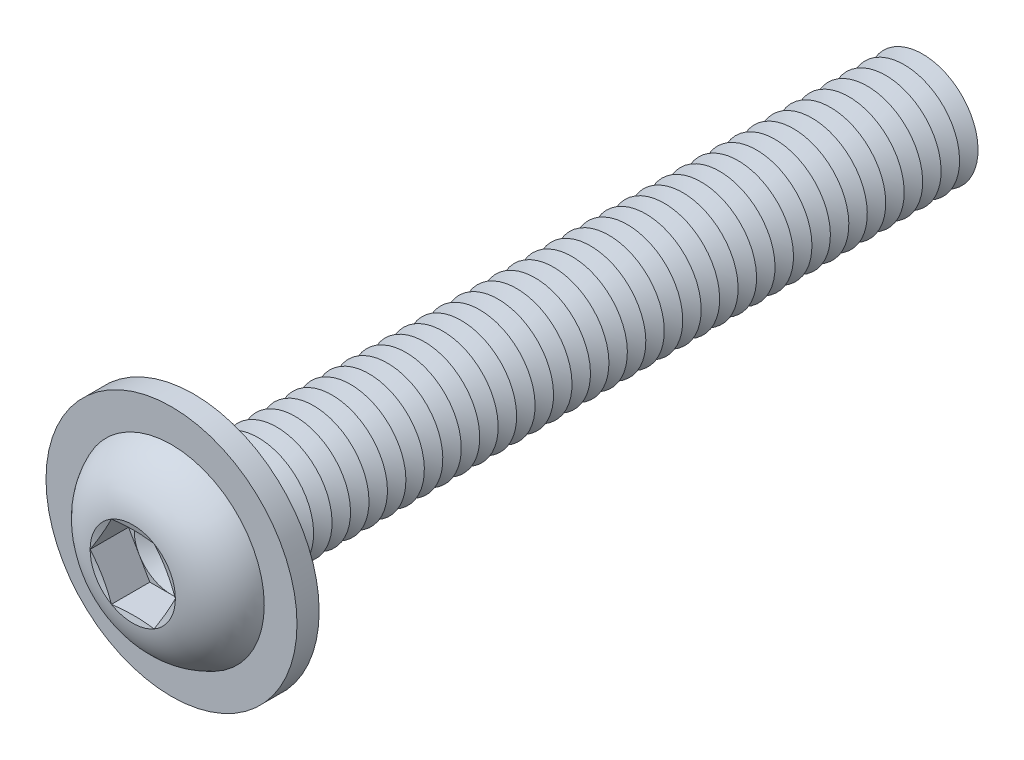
ISO-10303-21;
HEADER;
FILE_DESCRIPTION(('STEP AP214'),'2;1');
FILE_NAME('part.step','',(''),(''),'','','');
FILE_SCHEMA(('AUTOMOTIVE_DESIGN { 1 0 10303 214 1 1 1 1 }'));
ENDSEC;
DATA;
#1=APPLICATION_CONTEXT('core data for automotive mechanical design processes');
#2=APPLICATION_PROTOCOL_DEFINITION('international standard','automotive_design',2000,#1);
#3=PRODUCT_CONTEXT('',#1,'mechanical');
#4=PRODUCT('Part','Part','',(#3));
#5=PRODUCT_RELATED_PRODUCT_CATEGORY('part','',(#4));
#6=PRODUCT_DEFINITION_FORMATION('','',#4);
#7=PRODUCT_DEFINITION_CONTEXT('part definition',#1,'design');
#8=PRODUCT_DEFINITION('design','',#6,#7);
#9=PRODUCT_DEFINITION_SHAPE('','',#8);
#10=(LENGTH_UNIT() NAMED_UNIT(*) SI_UNIT(.MILLI.,.METRE.));
#11=(NAMED_UNIT(*) PLANE_ANGLE_UNIT() SI_UNIT($,.RADIAN.));
#12=(NAMED_UNIT(*) SI_UNIT($,.STERADIAN.) SOLID_ANGLE_UNIT());
#13=UNCERTAINTY_MEASURE_WITH_UNIT(LENGTH_MEASURE(1.E-05),#10,'distance_accuracy_value','');
#14=(GEOMETRIC_REPRESENTATION_CONTEXT(3) GLOBAL_UNCERTAINTY_ASSIGNED_CONTEXT((#13)) GLOBAL_UNIT_ASSIGNED_CONTEXT((#10,
#11,#12)) REPRESENTATION_CONTEXT('',''));
#15=CARTESIAN_POINT('',(0.,0.,0.));
#16=DIRECTION('',(0.,0.,1.));
#17=DIRECTION('',(1.,0.,0.));
#18=AXIS2_PLACEMENT_3D('',#15,#16,#17);
#19=CARTESIAN_POINT('',(0.,0.,-36.5));
#20=DIRECTION('',(0.,0.,1.));
#21=DIRECTION('',(0.,-1.,0.));
#22=AXIS2_PLACEMENT_3D('',#19,#20,#21);
#23=CONICAL_SURFACE('',#22,2.99999999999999,1.0471975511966);
#24=CARTESIAN_POINT('',(0.,0.,-37.));
#25=DIRECTION('',(0.,0.,1.));
#26=DIRECTION('',(0.,-1.,0.));
#27=AXIS2_PLACEMENT_3D('',#24,#25,#26);
#28=CIRCLE('',#27,2.13397459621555);
#29=CARTESIAN_POINT('',(0.,-2.13397459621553,-37.));
#30=VERTEX_POINT('',#29);
#31=EDGE_CURVE('E530',#30,#30,#28,.T.);
#32=ORIENTED_EDGE('',*,*,#31,.T.);
#33=EDGE_LOOP('',(#32));
#34=FACE_BOUND('',#33,.T.);
#35=CARTESIAN_POINT('',(0.,0.,-36.5));
#36=DIRECTION('',(0.,0.,1.));
#37=DIRECTION('',(0.,-1.,0.));
#38=AXIS2_PLACEMENT_3D('',#35,#36,#37);
#39=CIRCLE('',#38,2.99999999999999);
#40=CARTESIAN_POINT('',(0.,-2.99999999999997,-36.5));
#41=VERTEX_POINT('',#40);
#42=EDGE_CURVE('E526',#41,#41,#39,.T.);
#43=ORIENTED_EDGE('',*,*,#42,.F.);
#44=EDGE_LOOP('',(#43));
#45=FACE_BOUND('',#44,.T.);
#46=ADVANCED_FACE('F39',(#34,#45),#23,.T.);
#47=CARTESIAN_POINT('',(0.,0.,-37.));
#48=DIRECTION('',(0.,0.,-1.));
#49=DIRECTION('',(0.,1.,0.));
#50=AXIS2_PLACEMENT_3D('',#47,#48,#49);
#51=CONICAL_SURFACE('',#50,2.13397459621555,1.0471975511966);
#52=CARTESIAN_POINT('',(0.,0.,-37.5));
#53=DIRECTION('',(0.,0.,1.));
#54=DIRECTION('',(0.,-1.,0.));
#55=AXIS2_PLACEMENT_3D('',#52,#53,#54);
#56=CIRCLE('',#55,2.99999999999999);
#57=CARTESIAN_POINT('',(0.,-2.99999999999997,-37.5));
#58=VERTEX_POINT('',#57);
#59=EDGE_CURVE('E534',#58,#58,#56,.T.);
#60=ORIENTED_EDGE('',*,*,#59,.T.);
#61=EDGE_LOOP('',(#60));
#62=FACE_BOUND('',#61,.T.);
#63=ORIENTED_EDGE('',*,*,#31,.F.);
#64=EDGE_LOOP('',(#63));
#65=FACE_BOUND('',#64,.T.);
#66=ADVANCED_FACE('F649',(#62,#65),#51,.T.);
#67=CARTESIAN_POINT('',(0.,3.,-40.));
#68=DIRECTION('',(0.,0.,-1.));
#69=DIRECTION('',(0.,1.,0.));
#70=AXIS2_PLACEMENT_3D('',#67,#68,#69);
#71=PLANE('',#70);
#72=CARTESIAN_POINT('',(0.,0.,-40.));
#73=DIRECTION('',(0.,0.,1.));
#74=DIRECTION('',(0.,-1.,0.));
#75=AXIS2_PLACEMENT_3D('',#72,#73,#74);
#76=CIRCLE('',#75,2.13397459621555);
#77=CARTESIAN_POINT('',(0.,-2.13397459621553,-40.));
#78=VERTEX_POINT('',#77);
#79=EDGE_CURVE('E553',#78,#78,#76,.T.);
#80=ORIENTED_EDGE('',*,*,#79,.F.);
#81=EDGE_LOOP('',(#80));
#82=FACE_BOUND('',#81,.T.);
#83=ADVANCED_FACE('F655',(#82),#71,.T.);
#84=CARTESIAN_POINT('',(0.,0.,-39.5));
#85=DIRECTION('',(0.,0.,1.));
#86=DIRECTION('',(0.,-1.,0.));
#87=AXIS2_PLACEMENT_3D('',#84,#85,#86);
#88=CONICAL_SURFACE('',#87,2.99999999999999,1.0471975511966);
#89=ORIENTED_EDGE('',*,*,#79,.T.);
#90=EDGE_LOOP('',(#89));
#91=FACE_BOUND('',#90,.T.);
#92=CARTESIAN_POINT('',(0.,0.,-39.5));
#93=DIRECTION('',(0.,0.,1.));
#94=DIRECTION('',(0.,-1.,0.));
#95=AXIS2_PLACEMENT_3D('',#92,#93,#94);
#96=CIRCLE('',#95,2.99999999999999);
#97=CARTESIAN_POINT('',(0.,-2.99999999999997,-39.5));
#98=VERTEX_POINT('',#97);
#99=EDGE_CURVE('E549',#98,#98,#96,.T.);
#100=ORIENTED_EDGE('',*,*,#99,.F.);
#101=EDGE_LOOP('',(#100));
#102=FACE_BOUND('',#101,.T.);
#103=ADVANCED_FACE('F674',(#91,#102),#88,.T.);
#104=CARTESIAN_POINT('',(0.,0.,-39.));
#105=DIRECTION('',(0.,0.,-1.));
#106=DIRECTION('',(0.,1.,0.));
#107=AXIS2_PLACEMENT_3D('',#104,#105,#106);
#108=CONICAL_SURFACE('',#107,2.13397459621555,1.0471975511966);
#109=ORIENTED_EDGE('',*,*,#99,.T.);
#110=EDGE_LOOP('',(#109));
#111=FACE_BOUND('',#110,.T.);
#112=CARTESIAN_POINT('',(0.,0.,-39.));
#113=DIRECTION('',(0.,0.,1.));
#114=DIRECTION('',(0.,-1.,0.));
#115=AXIS2_PLACEMENT_3D('',#112,#113,#114);
#116=CIRCLE('',#115,2.13397459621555);
#117=CARTESIAN_POINT('',(0.,-2.13397459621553,-39.));
#118=VERTEX_POINT('',#117);
#119=EDGE_CURVE('E546',#118,#118,#116,.T.);
#120=ORIENTED_EDGE('',*,*,#119,.F.);
#121=EDGE_LOOP('',(#120));
#122=FACE_BOUND('',#121,.T.);
#123=ADVANCED_FACE('F671',(#111,#122),#108,.T.);
#124=CARTESIAN_POINT('',(0.,0.,-38.5));
#125=DIRECTION('',(0.,0.,1.));
#126=DIRECTION('',(0.,-1.,0.));
#127=AXIS2_PLACEMENT_3D('',#124,#125,#126);
#128=CONICAL_SURFACE('',#127,2.99999999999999,1.0471975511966);
#129=ORIENTED_EDGE('',*,*,#119,.T.);
#130=EDGE_LOOP('',(#129));
#131=FACE_BOUND('',#130,.T.);
#132=CARTESIAN_POINT('',(0.,0.,-38.5));
#133=DIRECTION('',(0.,0.,1.));
#134=DIRECTION('',(0.,-1.,0.));
#135=AXIS2_PLACEMENT_3D('',#132,#133,#134);
#136=CIRCLE('',#135,2.99999999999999);
#137=CARTESIAN_POINT('',(0.,-2.99999999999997,-38.5));
#138=VERTEX_POINT('',#137);
#139=EDGE_CURVE('E542',#138,#138,#136,.T.);
#140=ORIENTED_EDGE('',*,*,#139,.F.);
#141=EDGE_LOOP('',(#140));
#142=FACE_BOUND('',#141,.T.);
#143=ADVANCED_FACE('F665',(#131,#142),#128,.T.);
#144=CARTESIAN_POINT('',(0.,0.,-38.));
#145=DIRECTION('',(0.,0.,-1.));
#146=DIRECTION('',(0.,1.,0.));
#147=AXIS2_PLACEMENT_3D('',#144,#145,#146);
#148=CONICAL_SURFACE('',#147,2.13397459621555,1.0471975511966);
#149=ORIENTED_EDGE('',*,*,#139,.T.);
#150=EDGE_LOOP('',(#149));
#151=FACE_BOUND('',#150,.T.);
#152=CARTESIAN_POINT('',(0.,0.,-38.));
#153=DIRECTION('',(0.,0.,1.));
#154=DIRECTION('',(0.,-1.,0.));
#155=AXIS2_PLACEMENT_3D('',#152,#153,#154);
#156=CIRCLE('',#155,2.13397459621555);
#157=CARTESIAN_POINT('',(0.,-2.13397459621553,-38.));
#158=VERTEX_POINT('',#157);
#159=EDGE_CURVE('E538',#158,#158,#156,.T.);
#160=ORIENTED_EDGE('',*,*,#159,.F.);
#161=EDGE_LOOP('',(#160));
#162=FACE_BOUND('',#161,.T.);
#163=ADVANCED_FACE('F661',(#151,#162),#148,.T.);
#164=CARTESIAN_POINT('',(0.,0.,-37.5));
#165=DIRECTION('',(0.,0.,1.));
#166=DIRECTION('',(0.,-1.,0.));
#167=AXIS2_PLACEMENT_3D('',#164,#165,#166);
#168=CONICAL_SURFACE('',#167,2.99999999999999,1.0471975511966);
#169=ORIENTED_EDGE('',*,*,#159,.T.);
#170=EDGE_LOOP('',(#169));
#171=FACE_BOUND('',#170,.T.);
#172=ORIENTED_EDGE('',*,*,#59,.F.);
#173=EDGE_LOOP('',(#172));
#174=FACE_BOUND('',#173,.T.);
#175=ADVANCED_FACE('F664',(#171,#174),#168,.T.);
#176=CARTESIAN_POINT('',(0.,0.,-35.5));
#177=DIRECTION('',(0.,0.,1.));
#178=DIRECTION('',(0.,-1.,0.));
#179=AXIS2_PLACEMENT_3D('',#176,#177,#178);
#180=CONICAL_SURFACE('',#179,2.99999999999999,1.0471975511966);
#181=CARTESIAN_POINT('',(0.,0.,-36.));
#182=DIRECTION('',(0.,0.,1.));
#183=DIRECTION('',(0.,-1.,0.));
#184=AXIS2_PLACEMENT_3D('',#181,#182,#183);
#185=CIRCLE('',#184,2.13397459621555);
#186=CARTESIAN_POINT('',(0.,-2.13397459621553,-36.));
#187=VERTEX_POINT('',#186);
#188=EDGE_CURVE('E522',#187,#187,#185,.T.);
#189=ORIENTED_EDGE('',*,*,#188,.T.);
#190=EDGE_LOOP('',(#189));
#191=FACE_BOUND('',#190,.T.);
#192=CARTESIAN_POINT('',(0.,0.,-35.5));
#193=DIRECTION('',(0.,0.,1.));
#194=DIRECTION('',(0.,-1.,0.));
#195=AXIS2_PLACEMENT_3D('',#192,#193,#194);
#196=CIRCLE('',#195,2.99999999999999);
#197=CARTESIAN_POINT('',(0.,-2.99999999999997,-35.5));
#198=VERTEX_POINT('',#197);
#199=EDGE_CURVE('E518',#198,#198,#196,.T.);
#200=ORIENTED_EDGE('',*,*,#199,.F.);
#201=EDGE_LOOP('',(#200));
#202=FACE_BOUND('',#201,.T.);
#203=ADVANCED_FACE('F669',(#191,#202),#180,.T.);
#204=CARTESIAN_POINT('',(0.,0.,-36.));
#205=DIRECTION('',(0.,0.,-1.));
#206=DIRECTION('',(0.,1.,0.));
#207=AXIS2_PLACEMENT_3D('',#204,#205,#206);
#208=CONICAL_SURFACE('',#207,2.13397459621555,1.0471975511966);
#209=ORIENTED_EDGE('',*,*,#42,.T.);
#210=EDGE_LOOP('',(#209));
#211=FACE_BOUND('',#210,.T.);
#212=ORIENTED_EDGE('',*,*,#188,.F.);
#213=EDGE_LOOP('',(#212));
#214=FACE_BOUND('',#213,.T.);
#215=ADVANCED_FACE('F720',(#211,#214),#208,.T.);
#216=CARTESIAN_POINT('',(0.,0.,-34.5));
#217=DIRECTION('',(0.,0.,1.));
#218=DIRECTION('',(0.,-1.,0.));
#219=AXIS2_PLACEMENT_3D('',#216,#217,#218);
#220=CONICAL_SURFACE('',#219,2.99999999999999,1.0471975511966);
#221=CARTESIAN_POINT('',(0.,0.,-35.));
#222=DIRECTION('',(0.,0.,1.));
#223=DIRECTION('',(0.,-1.,0.));
#224=AXIS2_PLACEMENT_3D('',#221,#222,#223);
#225=CIRCLE('',#224,2.13397459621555);
#226=CARTESIAN_POINT('',(0.,-2.13397459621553,-35.));
#227=VERTEX_POINT('',#226);
#228=EDGE_CURVE('E514',#227,#227,#225,.T.);
#229=ORIENTED_EDGE('',*,*,#228,.T.);
#230=EDGE_LOOP('',(#229));
#231=FACE_BOUND('',#230,.T.);
#232=CARTESIAN_POINT('',(0.,0.,-34.5));
#233=DIRECTION('',(0.,0.,1.));
#234=DIRECTION('',(0.,-1.,0.));
#235=AXIS2_PLACEMENT_3D('',#232,#233,#234);
#236=CIRCLE('',#235,2.99999999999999);
#237=CARTESIAN_POINT('',(0.,-2.99999999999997,-34.5));
#238=VERTEX_POINT('',#237);
#239=EDGE_CURVE('E510',#238,#238,#236,.T.);
#240=ORIENTED_EDGE('',*,*,#239,.F.);
#241=EDGE_LOOP('',(#240));
#242=FACE_BOUND('',#241,.T.);
#243=ADVANCED_FACE('F726',(#231,#242),#220,.T.);
#244=CARTESIAN_POINT('',(0.,0.,-35.));
#245=DIRECTION('',(0.,0.,-1.));
#246=DIRECTION('',(0.,1.,0.));
#247=AXIS2_PLACEMENT_3D('',#244,#245,#246);
#248=CONICAL_SURFACE('',#247,2.13397459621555,1.0471975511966);
#249=ORIENTED_EDGE('',*,*,#199,.T.);
#250=EDGE_LOOP('',(#249));
#251=FACE_BOUND('',#250,.T.);
#252=ORIENTED_EDGE('',*,*,#228,.F.);
#253=EDGE_LOOP('',(#252));
#254=FACE_BOUND('',#253,.T.);
#255=ADVANCED_FACE('F733',(#251,#254),#248,.T.);
#256=CARTESIAN_POINT('',(0.,0.,-33.5));
#257=DIRECTION('',(0.,0.,1.));
#258=DIRECTION('',(0.,-1.,0.));
#259=AXIS2_PLACEMENT_3D('',#256,#257,#258);
#260=CONICAL_SURFACE('',#259,2.99999999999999,1.0471975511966);
#261=CARTESIAN_POINT('',(0.,0.,-34.));
#262=DIRECTION('',(0.,0.,1.));
#263=DIRECTION('',(0.,-1.,0.));
#264=AXIS2_PLACEMENT_3D('',#261,#262,#263);
#265=CIRCLE('',#264,2.13397459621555);
#266=CARTESIAN_POINT('',(0.,-2.13397459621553,-34.));
#267=VERTEX_POINT('',#266);
#268=EDGE_CURVE('E506',#267,#267,#265,.T.);
#269=ORIENTED_EDGE('',*,*,#268,.T.);
#270=EDGE_LOOP('',(#269));
#271=FACE_BOUND('',#270,.T.);
#272=CARTESIAN_POINT('',(0.,0.,-33.5));
#273=DIRECTION('',(0.,0.,1.));
#274=DIRECTION('',(0.,-1.,0.));
#275=AXIS2_PLACEMENT_3D('',#272,#273,#274);
#276=CIRCLE('',#275,2.99999999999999);
#277=CARTESIAN_POINT('',(0.,-2.99999999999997,-33.5));
#278=VERTEX_POINT('',#277);
#279=EDGE_CURVE('E502',#278,#278,#276,.T.);
#280=ORIENTED_EDGE('',*,*,#279,.F.);
#281=EDGE_LOOP('',(#280));
#282=FACE_BOUND('',#281,.T.);
#283=ADVANCED_FACE('F740',(#271,#282),#260,.T.);
#284=CARTESIAN_POINT('',(0.,0.,-34.));
#285=DIRECTION('',(0.,0.,-1.));
#286=DIRECTION('',(0.,1.,0.));
#287=AXIS2_PLACEMENT_3D('',#284,#285,#286);
#288=CONICAL_SURFACE('',#287,2.13397459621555,1.0471975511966);
#289=ORIENTED_EDGE('',*,*,#239,.T.);
#290=EDGE_LOOP('',(#289));
#291=FACE_BOUND('',#290,.T.);
#292=ORIENTED_EDGE('',*,*,#268,.F.);
#293=EDGE_LOOP('',(#292));
#294=FACE_BOUND('',#293,.T.);
#295=ADVANCED_FACE('F747',(#291,#294),#288,.T.);
#296=CARTESIAN_POINT('',(0.,0.,-32.5));
#297=DIRECTION('',(0.,0.,1.));
#298=DIRECTION('',(0.,-1.,0.));
#299=AXIS2_PLACEMENT_3D('',#296,#297,#298);
#300=CONICAL_SURFACE('',#299,2.99999999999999,1.0471975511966);
#301=CARTESIAN_POINT('',(0.,0.,-33.));
#302=DIRECTION('',(0.,0.,1.));
#303=DIRECTION('',(0.,-1.,0.));
#304=AXIS2_PLACEMENT_3D('',#301,#302,#303);
#305=CIRCLE('',#304,2.13397459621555);
#306=CARTESIAN_POINT('',(0.,-2.13397459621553,-33.));
#307=VERTEX_POINT('',#306);
#308=EDGE_CURVE('E498',#307,#307,#305,.T.);
#309=ORIENTED_EDGE('',*,*,#308,.T.);
#310=EDGE_LOOP('',(#309));
#311=FACE_BOUND('',#310,.T.);
#312=CARTESIAN_POINT('',(0.,0.,-32.5));
#313=DIRECTION('',(0.,0.,1.));
#314=DIRECTION('',(0.,-1.,0.));
#315=AXIS2_PLACEMENT_3D('',#312,#313,#314);
#316=CIRCLE('',#315,2.99999999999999);
#317=CARTESIAN_POINT('',(0.,-2.99999999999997,-32.5));
#318=VERTEX_POINT('',#317);
#319=EDGE_CURVE('E494',#318,#318,#316,.T.);
#320=ORIENTED_EDGE('',*,*,#319,.F.);
#321=EDGE_LOOP('',(#320));
#322=FACE_BOUND('',#321,.T.);
#323=ADVANCED_FACE('F754',(#311,#322),#300,.T.);
#324=CARTESIAN_POINT('',(0.,0.,-33.));
#325=DIRECTION('',(0.,0.,-1.));
#326=DIRECTION('',(0.,1.,0.));
#327=AXIS2_PLACEMENT_3D('',#324,#325,#326);
#328=CONICAL_SURFACE('',#327,2.13397459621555,1.0471975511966);
#329=ORIENTED_EDGE('',*,*,#279,.T.);
#330=EDGE_LOOP('',(#329));
#331=FACE_BOUND('',#330,.T.);
#332=ORIENTED_EDGE('',*,*,#308,.F.);
#333=EDGE_LOOP('',(#332));
#334=FACE_BOUND('',#333,.T.);
#335=ADVANCED_FACE('F761',(#331,#334),#328,.T.);
#336=CARTESIAN_POINT('',(0.,0.,-31.5));
#337=DIRECTION('',(0.,0.,1.));
#338=DIRECTION('',(0.,-1.,0.));
#339=AXIS2_PLACEMENT_3D('',#336,#337,#338);
#340=CONICAL_SURFACE('',#339,2.99999999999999,1.0471975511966);
#341=CARTESIAN_POINT('',(0.,0.,-32.));
#342=DIRECTION('',(0.,0.,1.));
#343=DIRECTION('',(0.,-1.,0.));
#344=AXIS2_PLACEMENT_3D('',#341,#342,#343);
#345=CIRCLE('',#344,2.13397459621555);
#346=CARTESIAN_POINT('',(0.,-2.13397459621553,-32.));
#347=VERTEX_POINT('',#346);
#348=EDGE_CURVE('E490',#347,#347,#345,.T.);
#349=ORIENTED_EDGE('',*,*,#348,.T.);
#350=EDGE_LOOP('',(#349));
#351=FACE_BOUND('',#350,.T.);
#352=CARTESIAN_POINT('',(0.,0.,-31.5));
#353=DIRECTION('',(0.,0.,1.));
#354=DIRECTION('',(0.,-1.,0.));
#355=AXIS2_PLACEMENT_3D('',#352,#353,#354);
#356=CIRCLE('',#355,2.99999999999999);
#357=CARTESIAN_POINT('',(0.,-2.99999999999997,-31.5));
#358=VERTEX_POINT('',#357);
#359=EDGE_CURVE('E486',#358,#358,#356,.T.);
#360=ORIENTED_EDGE('',*,*,#359,.F.);
#361=EDGE_LOOP('',(#360));
#362=FACE_BOUND('',#361,.T.);
#363=ADVANCED_FACE('F768',(#351,#362),#340,.T.);
#364=CARTESIAN_POINT('',(0.,0.,-32.));
#365=DIRECTION('',(0.,0.,-1.));
#366=DIRECTION('',(0.,1.,0.));
#367=AXIS2_PLACEMENT_3D('',#364,#365,#366);
#368=CONICAL_SURFACE('',#367,2.13397459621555,1.0471975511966);
#369=ORIENTED_EDGE('',*,*,#319,.T.);
#370=EDGE_LOOP('',(#369));
#371=FACE_BOUND('',#370,.T.);
#372=ORIENTED_EDGE('',*,*,#348,.F.);
#373=EDGE_LOOP('',(#372));
#374=FACE_BOUND('',#373,.T.);
#375=ADVANCED_FACE('F775',(#371,#374),#368,.T.);
#376=CARTESIAN_POINT('',(0.,0.,-30.5));
#377=DIRECTION('',(0.,0.,1.));
#378=DIRECTION('',(0.,-1.,0.));
#379=AXIS2_PLACEMENT_3D('',#376,#377,#378);
#380=CONICAL_SURFACE('',#379,2.99999999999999,1.0471975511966);
#381=CARTESIAN_POINT('',(0.,0.,-31.));
#382=DIRECTION('',(0.,0.,1.));
#383=DIRECTION('',(0.,-1.,0.));
#384=AXIS2_PLACEMENT_3D('',#381,#382,#383);
#385=CIRCLE('',#384,2.13397459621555);
#386=CARTESIAN_POINT('',(0.,-2.13397459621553,-31.));
#387=VERTEX_POINT('',#386);
#388=EDGE_CURVE('E482',#387,#387,#385,.T.);
#389=ORIENTED_EDGE('',*,*,#388,.T.);
#390=EDGE_LOOP('',(#389));
#391=FACE_BOUND('',#390,.T.);
#392=CARTESIAN_POINT('',(0.,0.,-30.5));
#393=DIRECTION('',(0.,0.,1.));
#394=DIRECTION('',(0.,-1.,0.));
#395=AXIS2_PLACEMENT_3D('',#392,#393,#394);
#396=CIRCLE('',#395,2.99999999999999);
#397=CARTESIAN_POINT('',(0.,-2.99999999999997,-30.5));
#398=VERTEX_POINT('',#397);
#399=EDGE_CURVE('E478',#398,#398,#396,.T.);
#400=ORIENTED_EDGE('',*,*,#399,.F.);
#401=EDGE_LOOP('',(#400));
#402=FACE_BOUND('',#401,.T.);
#403=ADVANCED_FACE('F782',(#391,#402),#380,.T.);
#404=CARTESIAN_POINT('',(0.,0.,-31.));
#405=DIRECTION('',(0.,0.,-1.));
#406=DIRECTION('',(0.,1.,0.));
#407=AXIS2_PLACEMENT_3D('',#404,#405,#406);
#408=CONICAL_SURFACE('',#407,2.13397459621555,1.0471975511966);
#409=ORIENTED_EDGE('',*,*,#359,.T.);
#410=EDGE_LOOP('',(#409));
#411=FACE_BOUND('',#410,.T.);
#412=ORIENTED_EDGE('',*,*,#388,.F.);
#413=EDGE_LOOP('',(#412));
#414=FACE_BOUND('',#413,.T.);
#415=ADVANCED_FACE('F789',(#411,#414),#408,.T.);
#416=CARTESIAN_POINT('',(0.,0.,-29.5));
#417=DIRECTION('',(0.,0.,1.));
#418=DIRECTION('',(0.,-1.,0.));
#419=AXIS2_PLACEMENT_3D('',#416,#417,#418);
#420=CONICAL_SURFACE('',#419,2.99999999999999,1.0471975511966);
#421=CARTESIAN_POINT('',(0.,0.,-30.));
#422=DIRECTION('',(0.,0.,1.));
#423=DIRECTION('',(0.,-1.,0.));
#424=AXIS2_PLACEMENT_3D('',#421,#422,#423);
#425=CIRCLE('',#424,2.13397459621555);
#426=CARTESIAN_POINT('',(0.,-2.13397459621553,-30.));
#427=VERTEX_POINT('',#426);
#428=EDGE_CURVE('E474',#427,#427,#425,.T.);
#429=ORIENTED_EDGE('',*,*,#428,.T.);
#430=EDGE_LOOP('',(#429));
#431=FACE_BOUND('',#430,.T.);
#432=CARTESIAN_POINT('',(0.,0.,-29.5));
#433=DIRECTION('',(0.,0.,1.));
#434=DIRECTION('',(0.,-1.,0.));
#435=AXIS2_PLACEMENT_3D('',#432,#433,#434);
#436=CIRCLE('',#435,2.99999999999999);
#437=CARTESIAN_POINT('',(0.,-2.99999999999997,-29.5));
#438=VERTEX_POINT('',#437);
#439=EDGE_CURVE('E470',#438,#438,#436,.T.);
#440=ORIENTED_EDGE('',*,*,#439,.F.);
#441=EDGE_LOOP('',(#440));
#442=FACE_BOUND('',#441,.T.);
#443=ADVANCED_FACE('F796',(#431,#442),#420,.T.);
#444=CARTESIAN_POINT('',(0.,0.,-30.));
#445=DIRECTION('',(0.,0.,-1.));
#446=DIRECTION('',(0.,1.,0.));
#447=AXIS2_PLACEMENT_3D('',#444,#445,#446);
#448=CONICAL_SURFACE('',#447,2.13397459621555,1.0471975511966);
#449=ORIENTED_EDGE('',*,*,#399,.T.);
#450=EDGE_LOOP('',(#449));
#451=FACE_BOUND('',#450,.T.);
#452=ORIENTED_EDGE('',*,*,#428,.F.);
#453=EDGE_LOOP('',(#452));
#454=FACE_BOUND('',#453,.T.);
#455=ADVANCED_FACE('F803',(#451,#454),#448,.T.);
#456=CARTESIAN_POINT('',(0.,0.,-28.5));
#457=DIRECTION('',(0.,0.,1.));
#458=DIRECTION('',(0.,-1.,0.));
#459=AXIS2_PLACEMENT_3D('',#456,#457,#458);
#460=CONICAL_SURFACE('',#459,2.99999999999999,1.0471975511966);
#461=CARTESIAN_POINT('',(0.,0.,-29.));
#462=DIRECTION('',(0.,0.,1.));
#463=DIRECTION('',(0.,-1.,0.));
#464=AXIS2_PLACEMENT_3D('',#461,#462,#463);
#465=CIRCLE('',#464,2.13397459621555);
#466=CARTESIAN_POINT('',(0.,-2.13397459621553,-29.));
#467=VERTEX_POINT('',#466);
#468=EDGE_CURVE('E466',#467,#467,#465,.T.);
#469=ORIENTED_EDGE('',*,*,#468,.T.);
#470=EDGE_LOOP('',(#469));
#471=FACE_BOUND('',#470,.T.);
#472=CARTESIAN_POINT('',(0.,0.,-28.5));
#473=DIRECTION('',(0.,0.,1.));
#474=DIRECTION('',(0.,-1.,0.));
#475=AXIS2_PLACEMENT_3D('',#472,#473,#474);
#476=CIRCLE('',#475,2.99999999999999);
#477=CARTESIAN_POINT('',(0.,-2.99999999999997,-28.5));
#478=VERTEX_POINT('',#477);
#479=EDGE_CURVE('E462',#478,#478,#476,.T.);
#480=ORIENTED_EDGE('',*,*,#479,.F.);
#481=EDGE_LOOP('',(#480));
#482=FACE_BOUND('',#481,.T.);
#483=ADVANCED_FACE('F810',(#471,#482),#460,.T.);
#484=CARTESIAN_POINT('',(0.,0.,-29.));
#485=DIRECTION('',(0.,0.,-1.));
#486=DIRECTION('',(0.,1.,0.));
#487=AXIS2_PLACEMENT_3D('',#484,#485,#486);
#488=CONICAL_SURFACE('',#487,2.13397459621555,1.0471975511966);
#489=ORIENTED_EDGE('',*,*,#439,.T.);
#490=EDGE_LOOP('',(#489));
#491=FACE_BOUND('',#490,.T.);
#492=ORIENTED_EDGE('',*,*,#468,.F.);
#493=EDGE_LOOP('',(#492));
#494=FACE_BOUND('',#493,.T.);
#495=ADVANCED_FACE('F817',(#491,#494),#488,.T.);
#496=CARTESIAN_POINT('',(0.,0.,-27.5));
#497=DIRECTION('',(0.,0.,1.));
#498=DIRECTION('',(0.,-1.,0.));
#499=AXIS2_PLACEMENT_3D('',#496,#497,#498);
#500=CONICAL_SURFACE('',#499,2.99999999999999,1.0471975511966);
#501=CARTESIAN_POINT('',(0.,0.,-28.));
#502=DIRECTION('',(0.,0.,1.));
#503=DIRECTION('',(0.,-1.,0.));
#504=AXIS2_PLACEMENT_3D('',#501,#502,#503);
#505=CIRCLE('',#504,2.13397459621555);
#506=CARTESIAN_POINT('',(0.,-2.13397459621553,-28.));
#507=VERTEX_POINT('',#506);
#508=EDGE_CURVE('E458',#507,#507,#505,.T.);
#509=ORIENTED_EDGE('',*,*,#508,.T.);
#510=EDGE_LOOP('',(#509));
#511=FACE_BOUND('',#510,.T.);
#512=CARTESIAN_POINT('',(0.,0.,-27.5));
#513=DIRECTION('',(0.,0.,1.));
#514=DIRECTION('',(0.,-1.,0.));
#515=AXIS2_PLACEMENT_3D('',#512,#513,#514);
#516=CIRCLE('',#515,2.99999999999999);
#517=CARTESIAN_POINT('',(0.,-2.99999999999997,-27.5));
#518=VERTEX_POINT('',#517);
#519=EDGE_CURVE('E454',#518,#518,#516,.T.);
#520=ORIENTED_EDGE('',*,*,#519,.F.);
#521=EDGE_LOOP('',(#520));
#522=FACE_BOUND('',#521,.T.);
#523=ADVANCED_FACE('F824',(#511,#522),#500,.T.);
#524=CARTESIAN_POINT('',(0.,0.,-28.));
#525=DIRECTION('',(0.,0.,-1.));
#526=DIRECTION('',(0.,1.,0.));
#527=AXIS2_PLACEMENT_3D('',#524,#525,#526);
#528=CONICAL_SURFACE('',#527,2.13397459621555,1.0471975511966);
#529=ORIENTED_EDGE('',*,*,#479,.T.);
#530=EDGE_LOOP('',(#529));
#531=FACE_BOUND('',#530,.T.);
#532=ORIENTED_EDGE('',*,*,#508,.F.);
#533=EDGE_LOOP('',(#532));
#534=FACE_BOUND('',#533,.T.);
#535=ADVANCED_FACE('F831',(#531,#534),#528,.T.);
#536=CARTESIAN_POINT('',(0.,0.,-26.5));
#537=DIRECTION('',(0.,0.,1.));
#538=DIRECTION('',(0.,-1.,0.));
#539=AXIS2_PLACEMENT_3D('',#536,#537,#538);
#540=CONICAL_SURFACE('',#539,2.99999999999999,1.0471975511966);
#541=CARTESIAN_POINT('',(0.,0.,-27.));
#542=DIRECTION('',(0.,0.,1.));
#543=DIRECTION('',(0.,-1.,0.));
#544=AXIS2_PLACEMENT_3D('',#541,#542,#543);
#545=CIRCLE('',#544,2.13397459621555);
#546=CARTESIAN_POINT('',(0.,-2.13397459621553,-27.));
#547=VERTEX_POINT('',#546);
#548=EDGE_CURVE('E450',#547,#547,#545,.T.);
#549=ORIENTED_EDGE('',*,*,#548,.T.);
#550=EDGE_LOOP('',(#549));
#551=FACE_BOUND('',#550,.T.);
#552=CARTESIAN_POINT('',(0.,0.,-26.5));
#553=DIRECTION('',(0.,0.,1.));
#554=DIRECTION('',(0.,-1.,0.));
#555=AXIS2_PLACEMENT_3D('',#552,#553,#554);
#556=CIRCLE('',#555,2.99999999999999);
#557=CARTESIAN_POINT('',(0.,-2.99999999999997,-26.5));
#558=VERTEX_POINT('',#557);
#559=EDGE_CURVE('E446',#558,#558,#556,.T.);
#560=ORIENTED_EDGE('',*,*,#559,.F.);
#561=EDGE_LOOP('',(#560));
#562=FACE_BOUND('',#561,.T.);
#563=ADVANCED_FACE('F838',(#551,#562),#540,.T.);
#564=CARTESIAN_POINT('',(0.,0.,-27.));
#565=DIRECTION('',(0.,0.,-1.));
#566=DIRECTION('',(0.,1.,0.));
#567=AXIS2_PLACEMENT_3D('',#564,#565,#566);
#568=CONICAL_SURFACE('',#567,2.13397459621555,1.0471975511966);
#569=ORIENTED_EDGE('',*,*,#519,.T.);
#570=EDGE_LOOP('',(#569));
#571=FACE_BOUND('',#570,.T.);
#572=ORIENTED_EDGE('',*,*,#548,.F.);
#573=EDGE_LOOP('',(#572));
#574=FACE_BOUND('',#573,.T.);
#575=ADVANCED_FACE('F845',(#571,#574),#568,.T.);
#576=CARTESIAN_POINT('',(0.,0.,-25.5));
#577=DIRECTION('',(0.,0.,1.));
#578=DIRECTION('',(0.,-1.,0.));
#579=AXIS2_PLACEMENT_3D('',#576,#577,#578);
#580=CONICAL_SURFACE('',#579,2.99999999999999,1.0471975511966);
#581=CARTESIAN_POINT('',(0.,0.,-26.));
#582=DIRECTION('',(0.,0.,1.));
#583=DIRECTION('',(0.,-1.,0.));
#584=AXIS2_PLACEMENT_3D('',#581,#582,#583);
#585=CIRCLE('',#584,2.13397459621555);
#586=CARTESIAN_POINT('',(0.,-2.13397459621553,-26.));
#587=VERTEX_POINT('',#586);
#588=EDGE_CURVE('E442',#587,#587,#585,.T.);
#589=ORIENTED_EDGE('',*,*,#588,.T.);
#590=EDGE_LOOP('',(#589));
#591=FACE_BOUND('',#590,.T.);
#592=CARTESIAN_POINT('',(0.,0.,-25.5));
#593=DIRECTION('',(0.,0.,1.));
#594=DIRECTION('',(0.,-1.,0.));
#595=AXIS2_PLACEMENT_3D('',#592,#593,#594);
#596=CIRCLE('',#595,2.99999999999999);
#597=CARTESIAN_POINT('',(0.,-2.99999999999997,-25.5));
#598=VERTEX_POINT('',#597);
#599=EDGE_CURVE('E438',#598,#598,#596,.T.);
#600=ORIENTED_EDGE('',*,*,#599,.F.);
#601=EDGE_LOOP('',(#600));
#602=FACE_BOUND('',#601,.T.);
#603=ADVANCED_FACE('F852',(#591,#602),#580,.T.);
#604=CARTESIAN_POINT('',(0.,0.,-26.));
#605=DIRECTION('',(0.,0.,-1.));
#606=DIRECTION('',(0.,1.,0.));
#607=AXIS2_PLACEMENT_3D('',#604,#605,#606);
#608=CONICAL_SURFACE('',#607,2.13397459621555,1.0471975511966);
#609=ORIENTED_EDGE('',*,*,#559,.T.);
#610=EDGE_LOOP('',(#609));
#611=FACE_BOUND('',#610,.T.);
#612=ORIENTED_EDGE('',*,*,#588,.F.);
#613=EDGE_LOOP('',(#612));
#614=FACE_BOUND('',#613,.T.);
#615=ADVANCED_FACE('F859',(#611,#614),#608,.T.);
#616=CARTESIAN_POINT('',(0.,0.,-24.5));
#617=DIRECTION('',(0.,0.,1.));
#618=DIRECTION('',(0.,-1.,0.));
#619=AXIS2_PLACEMENT_3D('',#616,#617,#618);
#620=CONICAL_SURFACE('',#619,2.99999999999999,1.0471975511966);
#621=CARTESIAN_POINT('',(0.,0.,-25.));
#622=DIRECTION('',(0.,0.,1.));
#623=DIRECTION('',(0.,-1.,0.));
#624=AXIS2_PLACEMENT_3D('',#621,#622,#623);
#625=CIRCLE('',#624,2.13397459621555);
#626=CARTESIAN_POINT('',(0.,-2.13397459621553,-25.));
#627=VERTEX_POINT('',#626);
#628=EDGE_CURVE('E434',#627,#627,#625,.T.);
#629=ORIENTED_EDGE('',*,*,#628,.T.);
#630=EDGE_LOOP('',(#629));
#631=FACE_BOUND('',#630,.T.);
#632=CARTESIAN_POINT('',(0.,0.,-24.5));
#633=DIRECTION('',(0.,0.,1.));
#634=DIRECTION('',(0.,-1.,0.));
#635=AXIS2_PLACEMENT_3D('',#632,#633,#634);
#636=CIRCLE('',#635,2.99999999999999);
#637=CARTESIAN_POINT('',(0.,-2.99999999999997,-24.5));
#638=VERTEX_POINT('',#637);
#639=EDGE_CURVE('E430',#638,#638,#636,.T.);
#640=ORIENTED_EDGE('',*,*,#639,.F.);
#641=EDGE_LOOP('',(#640));
#642=FACE_BOUND('',#641,.T.);
#643=ADVANCED_FACE('F866',(#631,#642),#620,.T.);
#644=CARTESIAN_POINT('',(0.,0.,-25.));
#645=DIRECTION('',(0.,0.,-1.));
#646=DIRECTION('',(0.,1.,0.));
#647=AXIS2_PLACEMENT_3D('',#644,#645,#646);
#648=CONICAL_SURFACE('',#647,2.13397459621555,1.0471975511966);
#649=ORIENTED_EDGE('',*,*,#599,.T.);
#650=EDGE_LOOP('',(#649));
#651=FACE_BOUND('',#650,.T.);
#652=ORIENTED_EDGE('',*,*,#628,.F.);
#653=EDGE_LOOP('',(#652));
#654=FACE_BOUND('',#653,.T.);
#655=ADVANCED_FACE('F873',(#651,#654),#648,.T.);
#656=CARTESIAN_POINT('',(0.,0.,-23.5));
#657=DIRECTION('',(0.,0.,1.));
#658=DIRECTION('',(0.,-1.,0.));
#659=AXIS2_PLACEMENT_3D('',#656,#657,#658);
#660=CONICAL_SURFACE('',#659,2.99999999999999,1.0471975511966);
#661=CARTESIAN_POINT('',(0.,0.,-24.));
#662=DIRECTION('',(0.,0.,1.));
#663=DIRECTION('',(0.,-1.,0.));
#664=AXIS2_PLACEMENT_3D('',#661,#662,#663);
#665=CIRCLE('',#664,2.13397459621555);
#666=CARTESIAN_POINT('',(0.,-2.13397459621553,-24.));
#667=VERTEX_POINT('',#666);
#668=EDGE_CURVE('E426',#667,#667,#665,.T.);
#669=ORIENTED_EDGE('',*,*,#668,.T.);
#670=EDGE_LOOP('',(#669));
#671=FACE_BOUND('',#670,.T.);
#672=CARTESIAN_POINT('',(0.,0.,-23.5));
#673=DIRECTION('',(0.,0.,1.));
#674=DIRECTION('',(0.,-1.,0.));
#675=AXIS2_PLACEMENT_3D('',#672,#673,#674);
#676=CIRCLE('',#675,2.99999999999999);
#677=CARTESIAN_POINT('',(0.,-2.99999999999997,-23.5));
#678=VERTEX_POINT('',#677);
#679=EDGE_CURVE('E422',#678,#678,#676,.T.);
#680=ORIENTED_EDGE('',*,*,#679,.F.);
#681=EDGE_LOOP('',(#680));
#682=FACE_BOUND('',#681,.T.);
#683=ADVANCED_FACE('F880',(#671,#682),#660,.T.);
#684=CARTESIAN_POINT('',(0.,0.,-24.));
#685=DIRECTION('',(0.,0.,-1.));
#686=DIRECTION('',(0.,1.,0.));
#687=AXIS2_PLACEMENT_3D('',#684,#685,#686);
#688=CONICAL_SURFACE('',#687,2.13397459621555,1.0471975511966);
#689=ORIENTED_EDGE('',*,*,#639,.T.);
#690=EDGE_LOOP('',(#689));
#691=FACE_BOUND('',#690,.T.);
#692=ORIENTED_EDGE('',*,*,#668,.F.);
#693=EDGE_LOOP('',(#692));
#694=FACE_BOUND('',#693,.T.);
#695=ADVANCED_FACE('F887',(#691,#694),#688,.T.);
#696=CARTESIAN_POINT('',(0.,0.,-22.5));
#697=DIRECTION('',(0.,0.,1.));
#698=DIRECTION('',(0.,-1.,0.));
#699=AXIS2_PLACEMENT_3D('',#696,#697,#698);
#700=CONICAL_SURFACE('',#699,2.99999999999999,1.0471975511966);
#701=CARTESIAN_POINT('',(0.,0.,-23.));
#702=DIRECTION('',(0.,0.,1.));
#703=DIRECTION('',(0.,-1.,0.));
#704=AXIS2_PLACEMENT_3D('',#701,#702,#703);
#705=CIRCLE('',#704,2.13397459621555);
#706=CARTESIAN_POINT('',(0.,-2.13397459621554,-23.));
#707=VERTEX_POINT('',#706);
#708=EDGE_CURVE('E418',#707,#707,#705,.T.);
#709=ORIENTED_EDGE('',*,*,#708,.T.);
#710=EDGE_LOOP('',(#709));
#711=FACE_BOUND('',#710,.T.);
#712=CARTESIAN_POINT('',(0.,0.,-22.5));
#713=DIRECTION('',(0.,0.,1.));
#714=DIRECTION('',(0.,-1.,0.));
#715=AXIS2_PLACEMENT_3D('',#712,#713,#714);
#716=CIRCLE('',#715,2.99999999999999);
#717=CARTESIAN_POINT('',(0.,-2.99999999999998,-22.5));
#718=VERTEX_POINT('',#717);
#719=EDGE_CURVE('E414',#718,#718,#716,.T.);
#720=ORIENTED_EDGE('',*,*,#719,.F.);
#721=EDGE_LOOP('',(#720));
#722=FACE_BOUND('',#721,.T.);
#723=ADVANCED_FACE('F894',(#711,#722),#700,.T.);
#724=CARTESIAN_POINT('',(0.,0.,-23.));
#725=DIRECTION('',(0.,0.,-1.));
#726=DIRECTION('',(0.,1.,0.));
#727=AXIS2_PLACEMENT_3D('',#724,#725,#726);
#728=CONICAL_SURFACE('',#727,2.13397459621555,1.0471975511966);
#729=ORIENTED_EDGE('',*,*,#679,.T.);
#730=EDGE_LOOP('',(#729));
#731=FACE_BOUND('',#730,.T.);
#732=ORIENTED_EDGE('',*,*,#708,.F.);
#733=EDGE_LOOP('',(#732));
#734=FACE_BOUND('',#733,.T.);
#735=ADVANCED_FACE('F901',(#731,#734),#728,.T.);
#736=CARTESIAN_POINT('',(0.,0.,-21.5));
#737=DIRECTION('',(0.,0.,1.));
#738=DIRECTION('',(0.,-1.,0.));
#739=AXIS2_PLACEMENT_3D('',#736,#737,#738);
#740=CONICAL_SURFACE('',#739,2.99999999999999,1.0471975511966);
#741=CARTESIAN_POINT('',(0.,0.,-22.));
#742=DIRECTION('',(0.,0.,1.));
#743=DIRECTION('',(0.,-1.,0.));
#744=AXIS2_PLACEMENT_3D('',#741,#742,#743);
#745=CIRCLE('',#744,2.13397459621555);
#746=CARTESIAN_POINT('',(0.,-2.13397459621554,-22.));
#747=VERTEX_POINT('',#746);
#748=EDGE_CURVE('E410',#747,#747,#745,.T.);
#749=ORIENTED_EDGE('',*,*,#748,.T.);
#750=EDGE_LOOP('',(#749));
#751=FACE_BOUND('',#750,.T.);
#752=CARTESIAN_POINT('',(0.,0.,-21.5));
#753=DIRECTION('',(0.,0.,1.));
#754=DIRECTION('',(0.,-1.,0.));
#755=AXIS2_PLACEMENT_3D('',#752,#753,#754);
#756=CIRCLE('',#755,2.99999999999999);
#757=CARTESIAN_POINT('',(0.,-2.99999999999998,-21.5));
#758=VERTEX_POINT('',#757);
#759=EDGE_CURVE('E406',#758,#758,#756,.T.);
#760=ORIENTED_EDGE('',*,*,#759,.F.);
#761=EDGE_LOOP('',(#760));
#762=FACE_BOUND('',#761,.T.);
#763=ADVANCED_FACE('F908',(#751,#762),#740,.T.);
#764=CARTESIAN_POINT('',(0.,0.,-22.));
#765=DIRECTION('',(0.,0.,-1.));
#766=DIRECTION('',(0.,1.,0.));
#767=AXIS2_PLACEMENT_3D('',#764,#765,#766);
#768=CONICAL_SURFACE('',#767,2.13397459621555,1.0471975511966);
#769=ORIENTED_EDGE('',*,*,#719,.T.);
#770=EDGE_LOOP('',(#769));
#771=FACE_BOUND('',#770,.T.);
#772=ORIENTED_EDGE('',*,*,#748,.F.);
#773=EDGE_LOOP('',(#772));
#774=FACE_BOUND('',#773,.T.);
#775=ADVANCED_FACE('F915',(#771,#774),#768,.T.);
#776=CARTESIAN_POINT('',(0.,0.,-20.5));
#777=DIRECTION('',(0.,0.,1.));
#778=DIRECTION('',(0.,-1.,0.));
#779=AXIS2_PLACEMENT_3D('',#776,#777,#778);
#780=CONICAL_SURFACE('',#779,2.99999999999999,1.0471975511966);
#781=CARTESIAN_POINT('',(0.,0.,-21.));
#782=DIRECTION('',(0.,0.,1.));
#783=DIRECTION('',(0.,-1.,0.));
#784=AXIS2_PLACEMENT_3D('',#781,#782,#783);
#785=CIRCLE('',#784,2.13397459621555);
#786=CARTESIAN_POINT('',(0.,-2.13397459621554,-21.));
#787=VERTEX_POINT('',#786);
#788=EDGE_CURVE('E402',#787,#787,#785,.T.);
#789=ORIENTED_EDGE('',*,*,#788,.T.);
#790=EDGE_LOOP('',(#789));
#791=FACE_BOUND('',#790,.T.);
#792=CARTESIAN_POINT('',(0.,0.,-20.5));
#793=DIRECTION('',(0.,0.,1.));
#794=DIRECTION('',(0.,-1.,0.));
#795=AXIS2_PLACEMENT_3D('',#792,#793,#794);
#796=CIRCLE('',#795,2.99999999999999);
#797=CARTESIAN_POINT('',(0.,-2.99999999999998,-20.5));
#798=VERTEX_POINT('',#797);
#799=EDGE_CURVE('E398',#798,#798,#796,.T.);
#800=ORIENTED_EDGE('',*,*,#799,.F.);
#801=EDGE_LOOP('',(#800));
#802=FACE_BOUND('',#801,.T.);
#803=ADVANCED_FACE('F922',(#791,#802),#780,.T.);
#804=CARTESIAN_POINT('',(0.,0.,-21.));
#805=DIRECTION('',(0.,0.,-1.));
#806=DIRECTION('',(0.,1.,0.));
#807=AXIS2_PLACEMENT_3D('',#804,#805,#806);
#808=CONICAL_SURFACE('',#807,2.13397459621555,1.0471975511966);
#809=ORIENTED_EDGE('',*,*,#759,.T.);
#810=EDGE_LOOP('',(#809));
#811=FACE_BOUND('',#810,.T.);
#812=ORIENTED_EDGE('',*,*,#788,.F.);
#813=EDGE_LOOP('',(#812));
#814=FACE_BOUND('',#813,.T.);
#815=ADVANCED_FACE('F929',(#811,#814),#808,.T.);
#816=CARTESIAN_POINT('',(0.,0.,-19.5));
#817=DIRECTION('',(0.,0.,1.));
#818=DIRECTION('',(0.,-1.,0.));
#819=AXIS2_PLACEMENT_3D('',#816,#817,#818);
#820=CONICAL_SURFACE('',#819,2.99999999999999,1.0471975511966);
#821=CARTESIAN_POINT('',(0.,0.,-20.));
#822=DIRECTION('',(0.,0.,1.));
#823=DIRECTION('',(0.,-1.,0.));
#824=AXIS2_PLACEMENT_3D('',#821,#822,#823);
#825=CIRCLE('',#824,2.13397459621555);
#826=CARTESIAN_POINT('',(0.,-2.13397459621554,-20.));
#827=VERTEX_POINT('',#826);
#828=EDGE_CURVE('E394',#827,#827,#825,.T.);
#829=ORIENTED_EDGE('',*,*,#828,.T.);
#830=EDGE_LOOP('',(#829));
#831=FACE_BOUND('',#830,.T.);
#832=CARTESIAN_POINT('',(0.,0.,-19.5));
#833=DIRECTION('',(0.,0.,1.));
#834=DIRECTION('',(0.,-1.,0.));
#835=AXIS2_PLACEMENT_3D('',#832,#833,#834);
#836=CIRCLE('',#835,2.99999999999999);
#837=CARTESIAN_POINT('',(0.,-2.99999999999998,-19.5));
#838=VERTEX_POINT('',#837);
#839=EDGE_CURVE('E390',#838,#838,#836,.T.);
#840=ORIENTED_EDGE('',*,*,#839,.F.);
#841=EDGE_LOOP('',(#840));
#842=FACE_BOUND('',#841,.T.);
#843=ADVANCED_FACE('F936',(#831,#842),#820,.T.);
#844=CARTESIAN_POINT('',(0.,0.,-20.));
#845=DIRECTION('',(0.,0.,-1.));
#846=DIRECTION('',(0.,1.,0.));
#847=AXIS2_PLACEMENT_3D('',#844,#845,#846);
#848=CONICAL_SURFACE('',#847,2.13397459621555,1.0471975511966);
#849=ORIENTED_EDGE('',*,*,#799,.T.);
#850=EDGE_LOOP('',(#849));
#851=FACE_BOUND('',#850,.T.);
#852=ORIENTED_EDGE('',*,*,#828,.F.);
#853=EDGE_LOOP('',(#852));
#854=FACE_BOUND('',#853,.T.);
#855=ADVANCED_FACE('F943',(#851,#854),#848,.T.);
#856=CARTESIAN_POINT('',(0.,0.,-18.5));
#857=DIRECTION('',(0.,0.,1.));
#858=DIRECTION('',(0.,-1.,0.));
#859=AXIS2_PLACEMENT_3D('',#856,#857,#858);
#860=CONICAL_SURFACE('',#859,2.99999999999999,1.0471975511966);
#861=CARTESIAN_POINT('',(0.,0.,-19.));
#862=DIRECTION('',(0.,0.,1.));
#863=DIRECTION('',(0.,-1.,0.));
#864=AXIS2_PLACEMENT_3D('',#861,#862,#863);
#865=CIRCLE('',#864,2.13397459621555);
#866=CARTESIAN_POINT('',(0.,-2.13397459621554,-19.));
#867=VERTEX_POINT('',#866);
#868=EDGE_CURVE('E386',#867,#867,#865,.T.);
#869=ORIENTED_EDGE('',*,*,#868,.T.);
#870=EDGE_LOOP('',(#869));
#871=FACE_BOUND('',#870,.T.);
#872=CARTESIAN_POINT('',(0.,0.,-18.5));
#873=DIRECTION('',(0.,0.,1.));
#874=DIRECTION('',(0.,-1.,0.));
#875=AXIS2_PLACEMENT_3D('',#872,#873,#874);
#876=CIRCLE('',#875,2.99999999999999);
#877=CARTESIAN_POINT('',(0.,-2.99999999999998,-18.5));
#878=VERTEX_POINT('',#877);
#879=EDGE_CURVE('E382',#878,#878,#876,.T.);
#880=ORIENTED_EDGE('',*,*,#879,.F.);
#881=EDGE_LOOP('',(#880));
#882=FACE_BOUND('',#881,.T.);
#883=ADVANCED_FACE('F950',(#871,#882),#860,.T.);
#884=CARTESIAN_POINT('',(0.,0.,-19.));
#885=DIRECTION('',(0.,0.,-1.));
#886=DIRECTION('',(0.,1.,0.));
#887=AXIS2_PLACEMENT_3D('',#884,#885,#886);
#888=CONICAL_SURFACE('',#887,2.13397459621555,1.0471975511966);
#889=ORIENTED_EDGE('',*,*,#839,.T.);
#890=EDGE_LOOP('',(#889));
#891=FACE_BOUND('',#890,.T.);
#892=ORIENTED_EDGE('',*,*,#868,.F.);
#893=EDGE_LOOP('',(#892));
#894=FACE_BOUND('',#893,.T.);
#895=ADVANCED_FACE('F957',(#891,#894),#888,.T.);
#896=CARTESIAN_POINT('',(0.,0.,-17.5));
#897=DIRECTION('',(0.,0.,1.));
#898=DIRECTION('',(0.,-1.,0.));
#899=AXIS2_PLACEMENT_3D('',#896,#897,#898);
#900=CONICAL_SURFACE('',#899,2.99999999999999,1.0471975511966);
#901=CARTESIAN_POINT('',(0.,0.,-18.));
#902=DIRECTION('',(0.,0.,1.));
#903=DIRECTION('',(0.,-1.,0.));
#904=AXIS2_PLACEMENT_3D('',#901,#902,#903);
#905=CIRCLE('',#904,2.13397459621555);
#906=CARTESIAN_POINT('',(0.,-2.13397459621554,-18.));
#907=VERTEX_POINT('',#906);
#908=EDGE_CURVE('E378',#907,#907,#905,.T.);
#909=ORIENTED_EDGE('',*,*,#908,.T.);
#910=EDGE_LOOP('',(#909));
#911=FACE_BOUND('',#910,.T.);
#912=CARTESIAN_POINT('',(0.,0.,-17.5));
#913=DIRECTION('',(0.,0.,1.));
#914=DIRECTION('',(0.,-1.,0.));
#915=AXIS2_PLACEMENT_3D('',#912,#913,#914);
#916=CIRCLE('',#915,2.99999999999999);
#917=CARTESIAN_POINT('',(0.,-2.99999999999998,-17.5));
#918=VERTEX_POINT('',#917);
#919=EDGE_CURVE('E374',#918,#918,#916,.T.);
#920=ORIENTED_EDGE('',*,*,#919,.F.);
#921=EDGE_LOOP('',(#920));
#922=FACE_BOUND('',#921,.T.);
#923=ADVANCED_FACE('F964',(#911,#922),#900,.T.);
#924=CARTESIAN_POINT('',(0.,0.,-18.));
#925=DIRECTION('',(0.,0.,-1.));
#926=DIRECTION('',(0.,1.,0.));
#927=AXIS2_PLACEMENT_3D('',#924,#925,#926);
#928=CONICAL_SURFACE('',#927,2.13397459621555,1.0471975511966);
#929=ORIENTED_EDGE('',*,*,#879,.T.);
#930=EDGE_LOOP('',(#929));
#931=FACE_BOUND('',#930,.T.);
#932=ORIENTED_EDGE('',*,*,#908,.F.);
#933=EDGE_LOOP('',(#932));
#934=FACE_BOUND('',#933,.T.);
#935=ADVANCED_FACE('F971',(#931,#934),#928,.T.);
#936=CARTESIAN_POINT('',(0.,0.,-16.5));
#937=DIRECTION('',(0.,0.,1.));
#938=DIRECTION('',(0.,-1.,0.));
#939=AXIS2_PLACEMENT_3D('',#936,#937,#938);
#940=CONICAL_SURFACE('',#939,2.99999999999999,1.0471975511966);
#941=CARTESIAN_POINT('',(0.,0.,-17.));
#942=DIRECTION('',(0.,0.,1.));
#943=DIRECTION('',(0.,-1.,0.));
#944=AXIS2_PLACEMENT_3D('',#941,#942,#943);
#945=CIRCLE('',#944,2.13397459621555);
#946=CARTESIAN_POINT('',(0.,-2.13397459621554,-17.));
#947=VERTEX_POINT('',#946);
#948=EDGE_CURVE('E370',#947,#947,#945,.T.);
#949=ORIENTED_EDGE('',*,*,#948,.T.);
#950=EDGE_LOOP('',(#949));
#951=FACE_BOUND('',#950,.T.);
#952=CARTESIAN_POINT('',(0.,0.,-16.5));
#953=DIRECTION('',(0.,0.,1.));
#954=DIRECTION('',(0.,-1.,0.));
#955=AXIS2_PLACEMENT_3D('',#952,#953,#954);
#956=CIRCLE('',#955,2.99999999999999);
#957=CARTESIAN_POINT('',(0.,-2.99999999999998,-16.5));
#958=VERTEX_POINT('',#957);
#959=EDGE_CURVE('E366',#958,#958,#956,.T.);
#960=ORIENTED_EDGE('',*,*,#959,.F.);
#961=EDGE_LOOP('',(#960));
#962=FACE_BOUND('',#961,.T.);
#963=ADVANCED_FACE('F978',(#951,#962),#940,.T.);
#964=CARTESIAN_POINT('',(0.,0.,-17.));
#965=DIRECTION('',(0.,0.,-1.));
#966=DIRECTION('',(0.,1.,0.));
#967=AXIS2_PLACEMENT_3D('',#964,#965,#966);
#968=CONICAL_SURFACE('',#967,2.13397459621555,1.0471975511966);
#969=ORIENTED_EDGE('',*,*,#919,.T.);
#970=EDGE_LOOP('',(#969));
#971=FACE_BOUND('',#970,.T.);
#972=ORIENTED_EDGE('',*,*,#948,.F.);
#973=EDGE_LOOP('',(#972));
#974=FACE_BOUND('',#973,.T.);
#975=ADVANCED_FACE('F985',(#971,#974),#968,.T.);
#976=CARTESIAN_POINT('',(0.,0.,-15.5));
#977=DIRECTION('',(0.,0.,1.));
#978=DIRECTION('',(0.,-1.,0.));
#979=AXIS2_PLACEMENT_3D('',#976,#977,#978);
#980=CONICAL_SURFACE('',#979,2.99999999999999,1.0471975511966);
#981=CARTESIAN_POINT('',(0.,0.,-16.));
#982=DIRECTION('',(0.,0.,1.));
#983=DIRECTION('',(0.,-1.,0.));
#984=AXIS2_PLACEMENT_3D('',#981,#982,#983);
#985=CIRCLE('',#984,2.13397459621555);
#986=CARTESIAN_POINT('',(0.,-2.13397459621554,-16.));
#987=VERTEX_POINT('',#986);
#988=EDGE_CURVE('E362',#987,#987,#985,.T.);
#989=ORIENTED_EDGE('',*,*,#988,.T.);
#990=EDGE_LOOP('',(#989));
#991=FACE_BOUND('',#990,.T.);
#992=CARTESIAN_POINT('',(0.,0.,-15.5));
#993=DIRECTION('',(0.,0.,1.));
#994=DIRECTION('',(0.,-1.,0.));
#995=AXIS2_PLACEMENT_3D('',#992,#993,#994);
#996=CIRCLE('',#995,2.99999999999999);
#997=CARTESIAN_POINT('',(0.,-2.99999999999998,-15.5));
#998=VERTEX_POINT('',#997);
#999=EDGE_CURVE('E358',#998,#998,#996,.T.);
#1000=ORIENTED_EDGE('',*,*,#999,.F.);
#1001=EDGE_LOOP('',(#1000));
#1002=FACE_BOUND('',#1001,.T.);
#1003=ADVANCED_FACE('F992',(#991,#1002),#980,.T.);
#1004=CARTESIAN_POINT('',(0.,0.,-16.));
#1005=DIRECTION('',(0.,0.,-1.));
#1006=DIRECTION('',(0.,1.,0.));
#1007=AXIS2_PLACEMENT_3D('',#1004,#1005,#1006);
#1008=CONICAL_SURFACE('',#1007,2.13397459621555,1.0471975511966);
#1009=ORIENTED_EDGE('',*,*,#959,.T.);
#1010=EDGE_LOOP('',(#1009));
#1011=FACE_BOUND('',#1010,.T.);
#1012=ORIENTED_EDGE('',*,*,#988,.F.);
#1013=EDGE_LOOP('',(#1012));
#1014=FACE_BOUND('',#1013,.T.);
#1015=ADVANCED_FACE('F999',(#1011,#1014),#1008,.T.);
#1016=CARTESIAN_POINT('',(0.,0.,-14.5));
#1017=DIRECTION('',(0.,0.,1.));
#1018=DIRECTION('',(0.,-1.,0.));
#1019=AXIS2_PLACEMENT_3D('',#1016,#1017,#1018);
#1020=CONICAL_SURFACE('',#1019,2.99999999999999,1.0471975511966);
#1021=CARTESIAN_POINT('',(0.,0.,-15.));
#1022=DIRECTION('',(0.,0.,1.));
#1023=DIRECTION('',(0.,-1.,0.));
#1024=AXIS2_PLACEMENT_3D('',#1021,#1022,#1023);
#1025=CIRCLE('',#1024,2.13397459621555);
#1026=CARTESIAN_POINT('',(0.,-2.13397459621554,-15.));
#1027=VERTEX_POINT('',#1026);
#1028=EDGE_CURVE('E354',#1027,#1027,#1025,.T.);
#1029=ORIENTED_EDGE('',*,*,#1028,.T.);
#1030=EDGE_LOOP('',(#1029));
#1031=FACE_BOUND('',#1030,.T.);
#1032=CARTESIAN_POINT('',(0.,0.,-14.5));
#1033=DIRECTION('',(0.,0.,1.));
#1034=DIRECTION('',(0.,-1.,0.));
#1035=AXIS2_PLACEMENT_3D('',#1032,#1033,#1034);
#1036=CIRCLE('',#1035,2.99999999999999);
#1037=CARTESIAN_POINT('',(0.,-2.99999999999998,-14.5));
#1038=VERTEX_POINT('',#1037);
#1039=EDGE_CURVE('E350',#1038,#1038,#1036,.T.);
#1040=ORIENTED_EDGE('',*,*,#1039,.F.);
#1041=EDGE_LOOP('',(#1040));
#1042=FACE_BOUND('',#1041,.T.);
#1043=ADVANCED_FACE('F1006',(#1031,#1042),#1020,.T.);
#1044=CARTESIAN_POINT('',(0.,0.,-15.));
#1045=DIRECTION('',(0.,0.,-1.));
#1046=DIRECTION('',(0.,1.,0.));
#1047=AXIS2_PLACEMENT_3D('',#1044,#1045,#1046);
#1048=CONICAL_SURFACE('',#1047,2.13397459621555,1.0471975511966);
#1049=ORIENTED_EDGE('',*,*,#999,.T.);
#1050=EDGE_LOOP('',(#1049));
#1051=FACE_BOUND('',#1050,.T.);
#1052=ORIENTED_EDGE('',*,*,#1028,.F.);
#1053=EDGE_LOOP('',(#1052));
#1054=FACE_BOUND('',#1053,.T.);
#1055=ADVANCED_FACE('F1013',(#1051,#1054),#1048,.T.);
#1056=CARTESIAN_POINT('',(0.,0.,-13.5));
#1057=DIRECTION('',(0.,0.,1.));
#1058=DIRECTION('',(0.,-1.,0.));
#1059=AXIS2_PLACEMENT_3D('',#1056,#1057,#1058);
#1060=CONICAL_SURFACE('',#1059,2.99999999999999,1.0471975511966);
#1061=CARTESIAN_POINT('',(0.,0.,-14.));
#1062=DIRECTION('',(0.,0.,1.));
#1063=DIRECTION('',(0.,-1.,0.));
#1064=AXIS2_PLACEMENT_3D('',#1061,#1062,#1063);
#1065=CIRCLE('',#1064,2.13397459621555);
#1066=CARTESIAN_POINT('',(0.,-2.13397459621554,-14.));
#1067=VERTEX_POINT('',#1066);
#1068=EDGE_CURVE('E346',#1067,#1067,#1065,.T.);
#1069=ORIENTED_EDGE('',*,*,#1068,.T.);
#1070=EDGE_LOOP('',(#1069));
#1071=FACE_BOUND('',#1070,.T.);
#1072=CARTESIAN_POINT('',(0.,0.,-13.5));
#1073=DIRECTION('',(0.,0.,1.));
#1074=DIRECTION('',(0.,-1.,0.));
#1075=AXIS2_PLACEMENT_3D('',#1072,#1073,#1074);
#1076=CIRCLE('',#1075,2.99999999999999);
#1077=CARTESIAN_POINT('',(0.,-2.99999999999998,-13.5));
#1078=VERTEX_POINT('',#1077);
#1079=EDGE_CURVE('E342',#1078,#1078,#1076,.T.);
#1080=ORIENTED_EDGE('',*,*,#1079,.F.);
#1081=EDGE_LOOP('',(#1080));
#1082=FACE_BOUND('',#1081,.T.);
#1083=ADVANCED_FACE('F1020',(#1071,#1082),#1060,.T.);
#1084=CARTESIAN_POINT('',(0.,0.,-14.));
#1085=DIRECTION('',(0.,0.,-1.));
#1086=DIRECTION('',(0.,1.,0.));
#1087=AXIS2_PLACEMENT_3D('',#1084,#1085,#1086);
#1088=CONICAL_SURFACE('',#1087,2.13397459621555,1.0471975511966);
#1089=ORIENTED_EDGE('',*,*,#1039,.T.);
#1090=EDGE_LOOP('',(#1089));
#1091=FACE_BOUND('',#1090,.T.);
#1092=ORIENTED_EDGE('',*,*,#1068,.F.);
#1093=EDGE_LOOP('',(#1092));
#1094=FACE_BOUND('',#1093,.T.);
#1095=ADVANCED_FACE('F1027',(#1091,#1094),#1088,.T.);
#1096=CARTESIAN_POINT('',(0.,0.,-12.5));
#1097=DIRECTION('',(0.,0.,1.));
#1098=DIRECTION('',(0.,-1.,0.));
#1099=AXIS2_PLACEMENT_3D('',#1096,#1097,#1098);
#1100=CONICAL_SURFACE('',#1099,2.99999999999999,1.0471975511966);
#1101=CARTESIAN_POINT('',(0.,0.,-13.));
#1102=DIRECTION('',(0.,0.,1.));
#1103=DIRECTION('',(0.,-1.,0.));
#1104=AXIS2_PLACEMENT_3D('',#1101,#1102,#1103);
#1105=CIRCLE('',#1104,2.13397459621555);
#1106=CARTESIAN_POINT('',(0.,-2.13397459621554,-13.));
#1107=VERTEX_POINT('',#1106);
#1108=EDGE_CURVE('E338',#1107,#1107,#1105,.T.);
#1109=ORIENTED_EDGE('',*,*,#1108,.T.);
#1110=EDGE_LOOP('',(#1109));
#1111=FACE_BOUND('',#1110,.T.);
#1112=CARTESIAN_POINT('',(0.,0.,-12.5));
#1113=DIRECTION('',(0.,0.,1.));
#1114=DIRECTION('',(0.,-1.,0.));
#1115=AXIS2_PLACEMENT_3D('',#1112,#1113,#1114);
#1116=CIRCLE('',#1115,2.99999999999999);
#1117=CARTESIAN_POINT('',(0.,-2.99999999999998,-12.5));
#1118=VERTEX_POINT('',#1117);
#1119=EDGE_CURVE('E334',#1118,#1118,#1116,.T.);
#1120=ORIENTED_EDGE('',*,*,#1119,.F.);
#1121=EDGE_LOOP('',(#1120));
#1122=FACE_BOUND('',#1121,.T.);
#1123=ADVANCED_FACE('F1034',(#1111,#1122),#1100,.T.);
#1124=CARTESIAN_POINT('',(0.,0.,-13.));
#1125=DIRECTION('',(0.,0.,-1.));
#1126=DIRECTION('',(0.,1.,0.));
#1127=AXIS2_PLACEMENT_3D('',#1124,#1125,#1126);
#1128=CONICAL_SURFACE('',#1127,2.13397459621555,1.0471975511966);
#1129=ORIENTED_EDGE('',*,*,#1079,.T.);
#1130=EDGE_LOOP('',(#1129));
#1131=FACE_BOUND('',#1130,.T.);
#1132=ORIENTED_EDGE('',*,*,#1108,.F.);
#1133=EDGE_LOOP('',(#1132));
#1134=FACE_BOUND('',#1133,.T.);
#1135=ADVANCED_FACE('F1041',(#1131,#1134),#1128,.T.);
#1136=CARTESIAN_POINT('',(0.,0.,-11.5));
#1137=DIRECTION('',(0.,0.,1.));
#1138=DIRECTION('',(0.,-1.,0.));
#1139=AXIS2_PLACEMENT_3D('',#1136,#1137,#1138);
#1140=CONICAL_SURFACE('',#1139,2.99999999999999,1.0471975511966);
#1141=CARTESIAN_POINT('',(0.,0.,-12.));
#1142=DIRECTION('',(0.,0.,1.));
#1143=DIRECTION('',(0.,-1.,0.));
#1144=AXIS2_PLACEMENT_3D('',#1141,#1142,#1143);
#1145=CIRCLE('',#1144,2.13397459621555);
#1146=CARTESIAN_POINT('',(0.,-2.13397459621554,-12.));
#1147=VERTEX_POINT('',#1146);
#1148=EDGE_CURVE('E330',#1147,#1147,#1145,.T.);
#1149=ORIENTED_EDGE('',*,*,#1148,.T.);
#1150=EDGE_LOOP('',(#1149));
#1151=FACE_BOUND('',#1150,.T.);
#1152=CARTESIAN_POINT('',(0.,0.,-11.5));
#1153=DIRECTION('',(0.,0.,1.));
#1154=DIRECTION('',(0.,-1.,0.));
#1155=AXIS2_PLACEMENT_3D('',#1152,#1153,#1154);
#1156=CIRCLE('',#1155,2.99999999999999);
#1157=CARTESIAN_POINT('',(0.,-2.99999999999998,-11.5));
#1158=VERTEX_POINT('',#1157);
#1159=EDGE_CURVE('E326',#1158,#1158,#1156,.T.);
#1160=ORIENTED_EDGE('',*,*,#1159,.F.);
#1161=EDGE_LOOP('',(#1160));
#1162=FACE_BOUND('',#1161,.T.);
#1163=ADVANCED_FACE('F1048',(#1151,#1162),#1140,.T.);
#1164=CARTESIAN_POINT('',(0.,0.,-12.));
#1165=DIRECTION('',(0.,0.,-1.));
#1166=DIRECTION('',(0.,1.,0.));
#1167=AXIS2_PLACEMENT_3D('',#1164,#1165,#1166);
#1168=CONICAL_SURFACE('',#1167,2.13397459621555,1.0471975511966);
#1169=ORIENTED_EDGE('',*,*,#1119,.T.);
#1170=EDGE_LOOP('',(#1169));
#1171=FACE_BOUND('',#1170,.T.);
#1172=ORIENTED_EDGE('',*,*,#1148,.F.);
#1173=EDGE_LOOP('',(#1172));
#1174=FACE_BOUND('',#1173,.T.);
#1175=ADVANCED_FACE('F1055',(#1171,#1174),#1168,.T.);
#1176=CARTESIAN_POINT('',(0.,0.,-10.5));
#1177=DIRECTION('',(0.,0.,1.));
#1178=DIRECTION('',(0.,-1.,0.));
#1179=AXIS2_PLACEMENT_3D('',#1176,#1177,#1178);
#1180=CONICAL_SURFACE('',#1179,2.99999999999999,1.0471975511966);
#1181=CARTESIAN_POINT('',(0.,0.,-11.));
#1182=DIRECTION('',(0.,0.,1.));
#1183=DIRECTION('',(0.,-1.,0.));
#1184=AXIS2_PLACEMENT_3D('',#1181,#1182,#1183);
#1185=CIRCLE('',#1184,2.13397459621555);
#1186=CARTESIAN_POINT('',(0.,-2.13397459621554,-11.));
#1187=VERTEX_POINT('',#1186);
#1188=EDGE_CURVE('E322',#1187,#1187,#1185,.T.);
#1189=ORIENTED_EDGE('',*,*,#1188,.T.);
#1190=EDGE_LOOP('',(#1189));
#1191=FACE_BOUND('',#1190,.T.);
#1192=CARTESIAN_POINT('',(0.,0.,-10.5));
#1193=DIRECTION('',(0.,0.,1.));
#1194=DIRECTION('',(0.,-1.,0.));
#1195=AXIS2_PLACEMENT_3D('',#1192,#1193,#1194);
#1196=CIRCLE('',#1195,2.99999999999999);
#1197=CARTESIAN_POINT('',(0.,-2.99999999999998,-10.5));
#1198=VERTEX_POINT('',#1197);
#1199=EDGE_CURVE('E318',#1198,#1198,#1196,.T.);
#1200=ORIENTED_EDGE('',*,*,#1199,.F.);
#1201=EDGE_LOOP('',(#1200));
#1202=FACE_BOUND('',#1201,.T.);
#1203=ADVANCED_FACE('F1062',(#1191,#1202),#1180,.T.);
#1204=CARTESIAN_POINT('',(0.,0.,-11.));
#1205=DIRECTION('',(0.,0.,-1.));
#1206=DIRECTION('',(0.,1.,0.));
#1207=AXIS2_PLACEMENT_3D('',#1204,#1205,#1206);
#1208=CONICAL_SURFACE('',#1207,2.13397459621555,1.0471975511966);
#1209=ORIENTED_EDGE('',*,*,#1159,.T.);
#1210=EDGE_LOOP('',(#1209));
#1211=FACE_BOUND('',#1210,.T.);
#1212=ORIENTED_EDGE('',*,*,#1188,.F.);
#1213=EDGE_LOOP('',(#1212));
#1214=FACE_BOUND('',#1213,.T.);
#1215=ADVANCED_FACE('F1069',(#1211,#1214),#1208,.T.);
#1216=CARTESIAN_POINT('',(0.,0.,-9.49999999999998));
#1217=DIRECTION('',(0.,0.,1.));
#1218=DIRECTION('',(0.,-1.,0.));
#1219=AXIS2_PLACEMENT_3D('',#1216,#1217,#1218);
#1220=CONICAL_SURFACE('',#1219,2.99999999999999,1.0471975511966);
#1221=CARTESIAN_POINT('',(0.,0.,-9.99999999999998));
#1222=DIRECTION('',(0.,0.,1.));
#1223=DIRECTION('',(0.,-1.,0.));
#1224=AXIS2_PLACEMENT_3D('',#1221,#1222,#1223);
#1225=CIRCLE('',#1224,2.13397459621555);
#1226=CARTESIAN_POINT('',(0.,-2.13397459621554,-9.99999999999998));
#1227=VERTEX_POINT('',#1226);
#1228=EDGE_CURVE('E314',#1227,#1227,#1225,.T.);
#1229=ORIENTED_EDGE('',*,*,#1228,.T.);
#1230=EDGE_LOOP('',(#1229));
#1231=FACE_BOUND('',#1230,.T.);
#1232=CARTESIAN_POINT('',(0.,0.,-9.49999999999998));
#1233=DIRECTION('',(0.,0.,1.));
#1234=DIRECTION('',(0.,-1.,0.));
#1235=AXIS2_PLACEMENT_3D('',#1232,#1233,#1234);
#1236=CIRCLE('',#1235,2.99999999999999);
#1237=CARTESIAN_POINT('',(0.,-2.99999999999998,-9.49999999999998));
#1238=VERTEX_POINT('',#1237);
#1239=EDGE_CURVE('E310',#1238,#1238,#1236,.T.);
#1240=ORIENTED_EDGE('',*,*,#1239,.F.);
#1241=EDGE_LOOP('',(#1240));
#1242=FACE_BOUND('',#1241,.T.);
#1243=ADVANCED_FACE('F1076',(#1231,#1242),#1220,.T.);
#1244=CARTESIAN_POINT('',(0.,0.,-9.99999999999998));
#1245=DIRECTION('',(0.,0.,-1.));
#1246=DIRECTION('',(0.,1.,0.));
#1247=AXIS2_PLACEMENT_3D('',#1244,#1245,#1246);
#1248=CONICAL_SURFACE('',#1247,2.13397459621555,1.0471975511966);
#1249=ORIENTED_EDGE('',*,*,#1199,.T.);
#1250=EDGE_LOOP('',(#1249));
#1251=FACE_BOUND('',#1250,.T.);
#1252=ORIENTED_EDGE('',*,*,#1228,.F.);
#1253=EDGE_LOOP('',(#1252));
#1254=FACE_BOUND('',#1253,.T.);
#1255=ADVANCED_FACE('F1083',(#1251,#1254),#1248,.T.);
#1256=CARTESIAN_POINT('',(0.,0.,-8.49999999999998));
#1257=DIRECTION('',(0.,0.,1.));
#1258=DIRECTION('',(0.,-1.,0.));
#1259=AXIS2_PLACEMENT_3D('',#1256,#1257,#1258);
#1260=CONICAL_SURFACE('',#1259,2.99999999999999,1.0471975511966);
#1261=CARTESIAN_POINT('',(0.,0.,-8.99999999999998));
#1262=DIRECTION('',(0.,0.,1.));
#1263=DIRECTION('',(0.,-1.,0.));
#1264=AXIS2_PLACEMENT_3D('',#1261,#1262,#1263);
#1265=CIRCLE('',#1264,2.13397459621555);
#1266=CARTESIAN_POINT('',(0.,-2.13397459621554,-8.99999999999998));
#1267=VERTEX_POINT('',#1266);
#1268=EDGE_CURVE('E306',#1267,#1267,#1265,.T.);
#1269=ORIENTED_EDGE('',*,*,#1268,.T.);
#1270=EDGE_LOOP('',(#1269));
#1271=FACE_BOUND('',#1270,.T.);
#1272=CARTESIAN_POINT('',(0.,0.,-8.49999999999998));
#1273=DIRECTION('',(0.,0.,1.));
#1274=DIRECTION('',(0.,-1.,0.));
#1275=AXIS2_PLACEMENT_3D('',#1272,#1273,#1274);
#1276=CIRCLE('',#1275,2.99999999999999);
#1277=CARTESIAN_POINT('',(0.,-2.99999999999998,-8.49999999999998));
#1278=VERTEX_POINT('',#1277);
#1279=EDGE_CURVE('E302',#1278,#1278,#1276,.T.);
#1280=ORIENTED_EDGE('',*,*,#1279,.F.);
#1281=EDGE_LOOP('',(#1280));
#1282=FACE_BOUND('',#1281,.T.);
#1283=ADVANCED_FACE('F1090',(#1271,#1282),#1260,.T.);
#1284=CARTESIAN_POINT('',(0.,0.,-8.99999999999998));
#1285=DIRECTION('',(0.,0.,-1.));
#1286=DIRECTION('',(0.,1.,0.));
#1287=AXIS2_PLACEMENT_3D('',#1284,#1285,#1286);
#1288=CONICAL_SURFACE('',#1287,2.13397459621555,1.0471975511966);
#1289=ORIENTED_EDGE('',*,*,#1239,.T.);
#1290=EDGE_LOOP('',(#1289));
#1291=FACE_BOUND('',#1290,.T.);
#1292=ORIENTED_EDGE('',*,*,#1268,.F.);
#1293=EDGE_LOOP('',(#1292));
#1294=FACE_BOUND('',#1293,.T.);
#1295=ADVANCED_FACE('F1097',(#1291,#1294),#1288,.T.);
#1296=CARTESIAN_POINT('',(0.,0.,-7.49999999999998));
#1297=DIRECTION('',(0.,0.,1.));
#1298=DIRECTION('',(0.,-1.,0.));
#1299=AXIS2_PLACEMENT_3D('',#1296,#1297,#1298);
#1300=CONICAL_SURFACE('',#1299,2.99999999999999,1.0471975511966);
#1301=CARTESIAN_POINT('',(0.,0.,-7.99999999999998));
#1302=DIRECTION('',(0.,0.,1.));
#1303=DIRECTION('',(0.,-1.,0.));
#1304=AXIS2_PLACEMENT_3D('',#1301,#1302,#1303);
#1305=CIRCLE('',#1304,2.13397459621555);
#1306=CARTESIAN_POINT('',(0.,-2.13397459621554,-7.99999999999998));
#1307=VERTEX_POINT('',#1306);
#1308=EDGE_CURVE('E298',#1307,#1307,#1305,.T.);
#1309=ORIENTED_EDGE('',*,*,#1308,.T.);
#1310=EDGE_LOOP('',(#1309));
#1311=FACE_BOUND('',#1310,.T.);
#1312=CARTESIAN_POINT('',(0.,0.,-7.49999999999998));
#1313=DIRECTION('',(0.,0.,1.));
#1314=DIRECTION('',(0.,-1.,0.));
#1315=AXIS2_PLACEMENT_3D('',#1312,#1313,#1314);
#1316=CIRCLE('',#1315,2.99999999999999);
#1317=CARTESIAN_POINT('',(0.,-2.99999999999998,-7.49999999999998));
#1318=VERTEX_POINT('',#1317);
#1319=EDGE_CURVE('E294',#1318,#1318,#1316,.T.);
#1320=ORIENTED_EDGE('',*,*,#1319,.F.);
#1321=EDGE_LOOP('',(#1320));
#1322=FACE_BOUND('',#1321,.T.);
#1323=ADVANCED_FACE('F1104',(#1311,#1322),#1300,.T.);
#1324=CARTESIAN_POINT('',(0.,0.,-7.99999999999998));
#1325=DIRECTION('',(0.,0.,-1.));
#1326=DIRECTION('',(0.,1.,0.));
#1327=AXIS2_PLACEMENT_3D('',#1324,#1325,#1326);
#1328=CONICAL_SURFACE('',#1327,2.13397459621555,1.0471975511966);
#1329=ORIENTED_EDGE('',*,*,#1279,.T.);
#1330=EDGE_LOOP('',(#1329));
#1331=FACE_BOUND('',#1330,.T.);
#1332=ORIENTED_EDGE('',*,*,#1308,.F.);
#1333=EDGE_LOOP('',(#1332));
#1334=FACE_BOUND('',#1333,.T.);
#1335=ADVANCED_FACE('F1111',(#1331,#1334),#1328,.T.);
#1336=CARTESIAN_POINT('',(0.,0.,-6.49999999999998));
#1337=DIRECTION('',(0.,0.,1.));
#1338=DIRECTION('',(0.,-1.,0.));
#1339=AXIS2_PLACEMENT_3D('',#1336,#1337,#1338);
#1340=CONICAL_SURFACE('',#1339,2.99999999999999,1.0471975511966);
#1341=CARTESIAN_POINT('',(0.,0.,-6.99999999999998));
#1342=DIRECTION('',(0.,0.,1.));
#1343=DIRECTION('',(0.,-1.,0.));
#1344=AXIS2_PLACEMENT_3D('',#1341,#1342,#1343);
#1345=CIRCLE('',#1344,2.13397459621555);
#1346=CARTESIAN_POINT('',(0.,-2.13397459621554,-6.99999999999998));
#1347=VERTEX_POINT('',#1346);
#1348=EDGE_CURVE('E290',#1347,#1347,#1345,.T.);
#1349=ORIENTED_EDGE('',*,*,#1348,.T.);
#1350=EDGE_LOOP('',(#1349));
#1351=FACE_BOUND('',#1350,.T.);
#1352=CARTESIAN_POINT('',(0.,0.,-6.49999999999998));
#1353=DIRECTION('',(0.,0.,1.));
#1354=DIRECTION('',(0.,-1.,0.));
#1355=AXIS2_PLACEMENT_3D('',#1352,#1353,#1354);
#1356=CIRCLE('',#1355,2.99999999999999);
#1357=CARTESIAN_POINT('',(0.,-2.99999999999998,-6.49999999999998));
#1358=VERTEX_POINT('',#1357);
#1359=EDGE_CURVE('E286',#1358,#1358,#1356,.T.);
#1360=ORIENTED_EDGE('',*,*,#1359,.F.);
#1361=EDGE_LOOP('',(#1360));
#1362=FACE_BOUND('',#1361,.T.);
#1363=ADVANCED_FACE('F1118',(#1351,#1362),#1340,.T.);
#1364=CARTESIAN_POINT('',(0.,0.,-6.99999999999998));
#1365=DIRECTION('',(0.,0.,-1.));
#1366=DIRECTION('',(0.,1.,0.));
#1367=AXIS2_PLACEMENT_3D('',#1364,#1365,#1366);
#1368=CONICAL_SURFACE('',#1367,2.13397459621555,1.0471975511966);
#1369=ORIENTED_EDGE('',*,*,#1319,.T.);
#1370=EDGE_LOOP('',(#1369));
#1371=FACE_BOUND('',#1370,.T.);
#1372=ORIENTED_EDGE('',*,*,#1348,.F.);
#1373=EDGE_LOOP('',(#1372));
#1374=FACE_BOUND('',#1373,.T.);
#1375=ADVANCED_FACE('F1125',(#1371,#1374),#1368,.T.);
#1376=CARTESIAN_POINT('',(0.,0.,-5.49999999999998));
#1377=DIRECTION('',(0.,0.,1.));
#1378=DIRECTION('',(0.,-1.,0.));
#1379=AXIS2_PLACEMENT_3D('',#1376,#1377,#1378);
#1380=CONICAL_SURFACE('',#1379,2.99999999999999,1.0471975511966);
#1381=CARTESIAN_POINT('',(0.,0.,-5.99999999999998));
#1382=DIRECTION('',(0.,0.,1.));
#1383=DIRECTION('',(0.,-1.,0.));
#1384=AXIS2_PLACEMENT_3D('',#1381,#1382,#1383);
#1385=CIRCLE('',#1384,2.13397459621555);
#1386=CARTESIAN_POINT('',(0.,-2.13397459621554,-5.99999999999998));
#1387=VERTEX_POINT('',#1386);
#1388=EDGE_CURVE('E282',#1387,#1387,#1385,.T.);
#1389=ORIENTED_EDGE('',*,*,#1388,.T.);
#1390=EDGE_LOOP('',(#1389));
#1391=FACE_BOUND('',#1390,.T.);
#1392=CARTESIAN_POINT('',(0.,0.,-5.49999999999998));
#1393=DIRECTION('',(0.,0.,1.));
#1394=DIRECTION('',(0.,-1.,0.));
#1395=AXIS2_PLACEMENT_3D('',#1392,#1393,#1394);
#1396=CIRCLE('',#1395,2.99999999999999);
#1397=CARTESIAN_POINT('',(0.,-2.99999999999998,-5.49999999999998));
#1398=VERTEX_POINT('',#1397);
#1399=EDGE_CURVE('E278',#1398,#1398,#1396,.T.);
#1400=ORIENTED_EDGE('',*,*,#1399,.F.);
#1401=EDGE_LOOP('',(#1400));
#1402=FACE_BOUND('',#1401,.T.);
#1403=ADVANCED_FACE('F1132',(#1391,#1402),#1380,.T.);
#1404=CARTESIAN_POINT('',(0.,0.,-5.99999999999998));
#1405=DIRECTION('',(0.,0.,-1.));
#1406=DIRECTION('',(0.,1.,0.));
#1407=AXIS2_PLACEMENT_3D('',#1404,#1405,#1406);
#1408=CONICAL_SURFACE('',#1407,2.13397459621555,1.0471975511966);
#1409=ORIENTED_EDGE('',*,*,#1359,.T.);
#1410=EDGE_LOOP('',(#1409));
#1411=FACE_BOUND('',#1410,.T.);
#1412=ORIENTED_EDGE('',*,*,#1388,.F.);
#1413=EDGE_LOOP('',(#1412));
#1414=FACE_BOUND('',#1413,.T.);
#1415=ADVANCED_FACE('F1139',(#1411,#1414),#1408,.T.);
#1416=CARTESIAN_POINT('',(0.,0.,-4.49999999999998));
#1417=DIRECTION('',(0.,0.,1.));
#1418=DIRECTION('',(0.,-1.,0.));
#1419=AXIS2_PLACEMENT_3D('',#1416,#1417,#1418);
#1420=CONICAL_SURFACE('',#1419,2.99999999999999,1.0471975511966);
#1421=CARTESIAN_POINT('',(0.,0.,-4.99999999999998));
#1422=DIRECTION('',(0.,0.,1.));
#1423=DIRECTION('',(0.,-1.,0.));
#1424=AXIS2_PLACEMENT_3D('',#1421,#1422,#1423);
#1425=CIRCLE('',#1424,2.13397459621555);
#1426=CARTESIAN_POINT('',(0.,-2.13397459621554,-4.99999999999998));
#1427=VERTEX_POINT('',#1426);
#1428=EDGE_CURVE('E274',#1427,#1427,#1425,.T.);
#1429=ORIENTED_EDGE('',*,*,#1428,.T.);
#1430=EDGE_LOOP('',(#1429));
#1431=FACE_BOUND('',#1430,.T.);
#1432=CARTESIAN_POINT('',(0.,0.,-4.49999999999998));
#1433=DIRECTION('',(0.,0.,1.));
#1434=DIRECTION('',(0.,-1.,0.));
#1435=AXIS2_PLACEMENT_3D('',#1432,#1433,#1434);
#1436=CIRCLE('',#1435,2.99999999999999);
#1437=CARTESIAN_POINT('',(0.,-2.99999999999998,-4.49999999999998));
#1438=VERTEX_POINT('',#1437);
#1439=EDGE_CURVE('E270',#1438,#1438,#1436,.T.);
#1440=ORIENTED_EDGE('',*,*,#1439,.F.);
#1441=EDGE_LOOP('',(#1440));
#1442=FACE_BOUND('',#1441,.T.);
#1443=ADVANCED_FACE('F1146',(#1431,#1442),#1420,.T.);
#1444=CARTESIAN_POINT('',(0.,0.,-4.99999999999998));
#1445=DIRECTION('',(0.,0.,-1.));
#1446=DIRECTION('',(0.,1.,0.));
#1447=AXIS2_PLACEMENT_3D('',#1444,#1445,#1446);
#1448=CONICAL_SURFACE('',#1447,2.13397459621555,1.0471975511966);
#1449=ORIENTED_EDGE('',*,*,#1399,.T.);
#1450=EDGE_LOOP('',(#1449));
#1451=FACE_BOUND('',#1450,.T.);
#1452=ORIENTED_EDGE('',*,*,#1428,.F.);
#1453=EDGE_LOOP('',(#1452));
#1454=FACE_BOUND('',#1453,.T.);
#1455=ADVANCED_FACE('F1153',(#1451,#1454),#1448,.T.);
#1456=CARTESIAN_POINT('',(0.,0.,-3.49999999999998));
#1457=DIRECTION('',(0.,0.,1.));
#1458=DIRECTION('',(0.,-1.,0.));
#1459=AXIS2_PLACEMENT_3D('',#1456,#1457,#1458);
#1460=CONICAL_SURFACE('',#1459,2.99999999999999,1.0471975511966);
#1461=CARTESIAN_POINT('',(0.,0.,-3.99999999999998));
#1462=DIRECTION('',(0.,0.,1.));
#1463=DIRECTION('',(0.,-1.,0.));
#1464=AXIS2_PLACEMENT_3D('',#1461,#1462,#1463);
#1465=CIRCLE('',#1464,2.13397459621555);
#1466=CARTESIAN_POINT('',(0.,-2.13397459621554,-3.99999999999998));
#1467=VERTEX_POINT('',#1466);
#1468=EDGE_CURVE('E266',#1467,#1467,#1465,.T.);
#1469=ORIENTED_EDGE('',*,*,#1468,.T.);
#1470=EDGE_LOOP('',(#1469));
#1471=FACE_BOUND('',#1470,.T.);
#1472=CARTESIAN_POINT('',(0.,0.,-3.49999999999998));
#1473=DIRECTION('',(0.,0.,1.));
#1474=DIRECTION('',(0.,-1.,0.));
#1475=AXIS2_PLACEMENT_3D('',#1472,#1473,#1474);
#1476=CIRCLE('',#1475,2.99999999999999);
#1477=CARTESIAN_POINT('',(0.,-2.99999999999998,-3.49999999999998));
#1478=VERTEX_POINT('',#1477);
#1479=EDGE_CURVE('E262',#1478,#1478,#1476,.T.);
#1480=ORIENTED_EDGE('',*,*,#1479,.F.);
#1481=EDGE_LOOP('',(#1480));
#1482=FACE_BOUND('',#1481,.T.);
#1483=ADVANCED_FACE('F1160',(#1471,#1482),#1460,.T.);
#1484=CARTESIAN_POINT('',(0.,0.,-3.99999999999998));
#1485=DIRECTION('',(0.,0.,-1.));
#1486=DIRECTION('',(0.,1.,0.));
#1487=AXIS2_PLACEMENT_3D('',#1484,#1485,#1486);
#1488=CONICAL_SURFACE('',#1487,2.13397459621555,1.0471975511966);
#1489=ORIENTED_EDGE('',*,*,#1439,.T.);
#1490=EDGE_LOOP('',(#1489));
#1491=FACE_BOUND('',#1490,.T.);
#1492=ORIENTED_EDGE('',*,*,#1468,.F.);
#1493=EDGE_LOOP('',(#1492));
#1494=FACE_BOUND('',#1493,.T.);
#1495=ADVANCED_FACE('F1167',(#1491,#1494),#1488,.T.);
#1496=CARTESIAN_POINT('',(0.,0.,-2.49999999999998));
#1497=DIRECTION('',(0.,0.,1.));
#1498=DIRECTION('',(0.,-1.,0.));
#1499=AXIS2_PLACEMENT_3D('',#1496,#1497,#1498);
#1500=CONICAL_SURFACE('',#1499,2.99999999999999,1.0471975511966);
#1501=CARTESIAN_POINT('',(0.,0.,-2.99999999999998));
#1502=DIRECTION('',(0.,0.,1.));
#1503=DIRECTION('',(0.,-1.,0.));
#1504=AXIS2_PLACEMENT_3D('',#1501,#1502,#1503);
#1505=CIRCLE('',#1504,2.13397459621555);
#1506=CARTESIAN_POINT('',(0.,-2.13397459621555,-2.99999999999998));
#1507=VERTEX_POINT('',#1506);
#1508=EDGE_CURVE('E258',#1507,#1507,#1505,.T.);
#1509=ORIENTED_EDGE('',*,*,#1508,.T.);
#1510=EDGE_LOOP('',(#1509));
#1511=FACE_BOUND('',#1510,.T.);
#1512=CARTESIAN_POINT('',(0.,0.,-2.49999999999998));
#1513=DIRECTION('',(0.,0.,1.));
#1514=DIRECTION('',(0.,-1.,0.));
#1515=AXIS2_PLACEMENT_3D('',#1512,#1513,#1514);
#1516=CIRCLE('',#1515,2.99999999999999);
#1517=CARTESIAN_POINT('',(0.,-2.99999999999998,-2.49999999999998));
#1518=VERTEX_POINT('',#1517);
#1519=EDGE_CURVE('E254',#1518,#1518,#1516,.T.);
#1520=ORIENTED_EDGE('',*,*,#1519,.F.);
#1521=EDGE_LOOP('',(#1520));
#1522=FACE_BOUND('',#1521,.T.);
#1523=ADVANCED_FACE('F1174',(#1511,#1522),#1500,.T.);
#1524=CARTESIAN_POINT('',(0.,0.,-2.99999999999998));
#1525=DIRECTION('',(0.,0.,-1.));
#1526=DIRECTION('',(0.,1.,0.));
#1527=AXIS2_PLACEMENT_3D('',#1524,#1525,#1526);
#1528=CONICAL_SURFACE('',#1527,2.13397459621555,1.0471975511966);
#1529=ORIENTED_EDGE('',*,*,#1479,.T.);
#1530=EDGE_LOOP('',(#1529));
#1531=FACE_BOUND('',#1530,.T.);
#1532=ORIENTED_EDGE('',*,*,#1508,.F.);
#1533=EDGE_LOOP('',(#1532));
#1534=FACE_BOUND('',#1533,.T.);
#1535=ADVANCED_FACE('F1181',(#1531,#1534),#1528,.T.);
#1536=CARTESIAN_POINT('',(0.,0.,-1.49999999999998));
#1537=DIRECTION('',(0.,0.,1.));
#1538=DIRECTION('',(0.,-1.,0.));
#1539=AXIS2_PLACEMENT_3D('',#1536,#1537,#1538);
#1540=CONICAL_SURFACE('',#1539,2.99999999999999,1.0471975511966);
#1541=CARTESIAN_POINT('',(0.,0.,-1.99999999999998));
#1542=DIRECTION('',(0.,0.,1.));
#1543=DIRECTION('',(0.,-1.,0.));
#1544=AXIS2_PLACEMENT_3D('',#1541,#1542,#1543);
#1545=CIRCLE('',#1544,2.13397459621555);
#1546=CARTESIAN_POINT('',(0.,-2.13397459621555,-1.99999999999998));
#1547=VERTEX_POINT('',#1546);
#1548=EDGE_CURVE('E250',#1547,#1547,#1545,.T.);
#1549=ORIENTED_EDGE('',*,*,#1548,.T.);
#1550=EDGE_LOOP('',(#1549));
#1551=FACE_BOUND('',#1550,.T.);
#1552=CARTESIAN_POINT('',(0.,0.,-1.49999999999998));
#1553=DIRECTION('',(0.,0.,1.));
#1554=DIRECTION('',(0.,-1.,0.));
#1555=AXIS2_PLACEMENT_3D('',#1552,#1553,#1554);
#1556=CIRCLE('',#1555,2.99999999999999);
#1557=CARTESIAN_POINT('',(0.,-2.99999999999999,-1.49999999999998));
#1558=VERTEX_POINT('',#1557);
#1559=EDGE_CURVE('E242',#1558,#1558,#1556,.T.);
#1560=ORIENTED_EDGE('',*,*,#1559,.F.);
#1561=EDGE_LOOP('',(#1560));
#1562=FACE_BOUND('',#1561,.T.);
#1563=ADVANCED_FACE('F1188',(#1551,#1562),#1540,.T.);
#1564=CARTESIAN_POINT('',(0.,0.,-1.99999999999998));
#1565=DIRECTION('',(0.,0.,-1.));
#1566=DIRECTION('',(0.,1.,0.));
#1567=AXIS2_PLACEMENT_3D('',#1564,#1565,#1566);
#1568=CONICAL_SURFACE('',#1567,2.13397459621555,1.0471975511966);
#1569=ORIENTED_EDGE('',*,*,#1519,.T.);
#1570=EDGE_LOOP('',(#1569));
#1571=FACE_BOUND('',#1570,.T.);
#1572=ORIENTED_EDGE('',*,*,#1548,.F.);
#1573=EDGE_LOOP('',(#1572));
#1574=FACE_BOUND('',#1573,.T.);
#1575=ADVANCED_FACE('F1195',(#1571,#1574),#1568,.T.);
#1576=CARTESIAN_POINT('',(0.,0.,-0.49999999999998));
#1577=DIRECTION('',(0.,0.,1.));
#1578=DIRECTION('',(0.,-1.,0.));
#1579=AXIS2_PLACEMENT_3D('',#1576,#1577,#1578);
#1580=CONICAL_SURFACE('',#1579,2.99999999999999,1.0471975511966);
#1581=CARTESIAN_POINT('',(0.,0.,-0.99999999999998));
#1582=DIRECTION('',(0.,0.,1.));
#1583=DIRECTION('',(0.,-1.,0.));
#1584=AXIS2_PLACEMENT_3D('',#1581,#1582,#1583);
#1585=CIRCLE('',#1584,2.13397459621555);
#1586=CARTESIAN_POINT('',(0.,-2.13397459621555,-0.999999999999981));
#1587=VERTEX_POINT('',#1586);
#1588=EDGE_CURVE('E231',#1587,#1587,#1585,.T.);
#1589=ORIENTED_EDGE('',*,*,#1588,.T.);
#1590=EDGE_LOOP('',(#1589));
#1591=FACE_BOUND('',#1590,.T.);
#1592=CARTESIAN_POINT('',(0.,0.,-0.49999999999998));
#1593=DIRECTION('',(0.,0.,1.));
#1594=DIRECTION('',(0.,-1.,0.));
#1595=AXIS2_PLACEMENT_3D('',#1592,#1593,#1594);
#1596=CIRCLE('',#1595,2.99999999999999);
#1597=CARTESIAN_POINT('',(0.,-2.99999999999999,-0.499999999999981));
#1598=VERTEX_POINT('',#1597);
#1599=EDGE_CURVE('E246',#1598,#1598,#1596,.T.);
#1600=ORIENTED_EDGE('',*,*,#1599,.F.);
#1601=EDGE_LOOP('',(#1600));
#1602=FACE_BOUND('',#1601,.T.);
#1603=ADVANCED_FACE('F1202',(#1591,#1602),#1580,.T.);
#1604=CARTESIAN_POINT('',(0.,0.,-0.99999999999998));
#1605=DIRECTION('',(0.,0.,-1.));
#1606=DIRECTION('',(0.,1.,0.));
#1607=AXIS2_PLACEMENT_3D('',#1604,#1605,#1606);
#1608=CONICAL_SURFACE('',#1607,2.13397459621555,1.0471975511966);
#1609=ORIENTED_EDGE('',*,*,#1559,.T.);
#1610=EDGE_LOOP('',(#1609));
#1611=FACE_BOUND('',#1610,.T.);
#1612=ORIENTED_EDGE('',*,*,#1588,.F.);
#1613=EDGE_LOOP('',(#1612));
#1614=FACE_BOUND('',#1613,.T.);
#1615=ADVANCED_FACE('F220',(#1611,#1614),#1608,.T.);
#1616=CARTESIAN_POINT('',(0.,3.,0.));
#1617=DIRECTION('',(0.,0.,-1.));
#1618=DIRECTION('',(0.,1.,0.));
#1619=AXIS2_PLACEMENT_3D('',#1616,#1617,#1618);
#1620=PLANE('',#1619);
#1621=CARTESIAN_POINT('',(0.,0.,0.));
#1622=DIRECTION('',(0.,0.,-1.));
#1623=DIRECTION('',(0.,1.,0.));
#1624=AXIS2_PLACEMENT_3D('',#1621,#1622,#1623);
#1625=CIRCLE('',#1624,3.49999999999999);
#1626=CARTESIAN_POINT('',(0.,3.49999999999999,0.));
#1627=VERTEX_POINT('',#1626);
#1628=EDGE_CURVE('E562',#1627,#1627,#1625,.F.);
#1629=ORIENTED_EDGE('',*,*,#1628,.T.);
#1630=EDGE_LOOP('',(#1629));
#1631=FACE_BOUND('',#1630,.T.);
#1632=CARTESIAN_POINT('',(0.,0.,0.));
#1633=DIRECTION('',(0.,0.,-1.));
#1634=DIRECTION('',(0.,1.,0.));
#1635=AXIS2_PLACEMENT_3D('',#1632,#1633,#1634);
#1636=CIRCLE('',#1635,6.8);
#1637=CARTESIAN_POINT('',(0.,6.8,0.));
#1638=VERTEX_POINT('',#1637);
#1639=EDGE_CURVE('E1744',#1638,#1638,#1636,.T.);
#1640=ORIENTED_EDGE('',*,*,#1639,.T.);
#1641=EDGE_LOOP('',(#1640));
#1642=FACE_BOUND('',#1641,.T.);
#1643=ADVANCED_FACE('F1214',(#1631,#1642),#1620,.T.);
#1644=CARTESIAN_POINT('',(0.,0.,-0.5));
#1645=DIRECTION('',(0.,0.,-1.));
#1646=DIRECTION('',(0.,1.,0.));
#1647=AXIS2_PLACEMENT_3D('',#1644,#1645,#1646);
#1648=TOROIDAL_SURFACE('',#1647,3.49999999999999,0.5);
#1649=ORIENTED_EDGE('',*,*,#1628,.F.);
#1650=EDGE_LOOP('',(#1649));
#1651=FACE_BOUND('',#1650,.T.);
#1652=ORIENTED_EDGE('',*,*,#1599,.T.);
#1653=EDGE_LOOP('',(#1652));
#1654=FACE_BOUND('',#1653,.T.);
#1655=ADVANCED_FACE('F41',(#1651,#1654),#1648,.F.);
#1656=CARTESIAN_POINT('',(0.,0.,1.2));
#1657=DIRECTION('',(0.,0.,-1.));
#1658=DIRECTION('',(0.,1.,0.));
#1659=AXIS2_PLACEMENT_3D('',#1656,#1657,#1658);
#1660=CYLINDRICAL_SURFACE('',#1659,6.8);
#1661=CARTESIAN_POINT('',(0.,0.,1.2));
#1662=DIRECTION('',(0.,0.,-1.));
#1663=DIRECTION('',(0.,1.,0.));
#1664=AXIS2_PLACEMENT_3D('',#1661,#1662,#1663);
#1665=CIRCLE('',#1664,6.8);
#1666=CARTESIAN_POINT('',(0.,6.8,1.2));
#1667=VERTEX_POINT('',#1666);
#1668=EDGE_CURVE('E1746',#1667,#1667,#1665,.T.);
#1669=ORIENTED_EDGE('',*,*,#1668,.T.);
#1670=EDGE_LOOP('',(#1669));
#1671=FACE_BOUND('',#1670,.T.);
#1672=ORIENTED_EDGE('',*,*,#1639,.F.);
#1673=EDGE_LOOP('',(#1672));
#1674=FACE_BOUND('',#1673,.T.);
#1675=ADVANCED_FACE('F1225',(#1671,#1674),#1660,.T.);
#1676=CARTESIAN_POINT('',(0.,0.,1.2));
#1677=DIRECTION('',(0.,0.,-1.));
#1678=DIRECTION('',(0.,1.,0.));
#1679=AXIS2_PLACEMENT_3D('',#1676,#1677,#1678);
#1680=PLANE('',#1679);
#1681=CARTESIAN_POINT('',(0.,0.,1.2));
#1682=DIRECTION('',(0.,0.,-1.));
#1683=DIRECTION('',(0.,1.,0.));
#1684=AXIS2_PLACEMENT_3D('',#1681,#1682,#1683);
#1685=CIRCLE('',#1684,5.02568742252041);
#1686=CARTESIAN_POINT('',(0.,5.02568742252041,1.2));
#1687=VERTEX_POINT('',#1686);
#1688=EDGE_CURVE('E43',#1687,#1687,#1685,.F.);
#1689=ORIENTED_EDGE('',*,*,#1688,.F.);
#1690=EDGE_LOOP('',(#1689));
#1691=FACE_BOUND('',#1690,.T.);
#1692=ORIENTED_EDGE('',*,*,#1668,.F.);
#1693=EDGE_LOOP('',(#1692));
#1694=FACE_BOUND('',#1693,.T.);
#1695=ADVANCED_FACE('F117',(#1691,#1694),#1680,.F.);
#1696=CARTESIAN_POINT('',(0.,0.,1.22));
#1697=DIRECTION('',(0.,0.,1.));
#1698=DIRECTION('',(1.,0.,0.));
#1699=AXIS2_PLACEMENT_3D('',#1696,#1697,#1698);
#1700=CONICAL_SURFACE('',#1699,1.99999906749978,1.0471975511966);
#1701=CARTESIAN_POINT('',(0.,0.,0.0653000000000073));
#1702=VERTEX_POINT('',#1701);
#1703=VERTEX_LOOP('',#1702);
#1704=FACE_BOUND('',#1703,.T.);
#1705=CARTESIAN_POINT('',(0.,0.,1.22));
#1706=DIRECTION('',(0.,0.,1.));
#1707=DIRECTION('',(1.,0.,0.));
#1708=AXIS2_PLACEMENT_3D('',#1705,#1706,#1707);
#1709=CIRCLE('',#1708,1.99999906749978);
#1710=CARTESIAN_POINT('',(1.73205,0.999999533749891,1.22));
#1711=VERTEX_POINT('',#1710);
#1712=CARTESIAN_POINT('',(0.,1.99999906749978,1.22));
#1713=VERTEX_POINT('',#1712);
#1714=EDGE_CURVE('E120',#1711,#1713,#1709,.T.);
#1715=ORIENTED_EDGE('',*,*,#1714,.T.);
#1716=CARTESIAN_POINT('',(0.,0.,1.22));
#1717=DIRECTION('',(0.,0.,1.));
#1718=DIRECTION('',(1.,0.,0.));
#1719=AXIS2_PLACEMENT_3D('',#1716,#1717,#1718);
#1720=CIRCLE('',#1719,1.99999906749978);
#1721=CARTESIAN_POINT('',(-1.73205,0.999999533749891,1.22));
#1722=VERTEX_POINT('',#1721);
#1723=EDGE_CURVE('E11',#1713,#1722,#1720,.T.);
#1724=ORIENTED_EDGE('',*,*,#1723,.T.);
#1725=CARTESIAN_POINT('',(-1.73205,-0.999999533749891,1.22));
#1726=VERTEX_POINT('',#1725);
#1727=EDGE_CURVE('E49',#1722,#1726,#1720,.T.);
#1728=ORIENTED_EDGE('',*,*,#1727,.T.);
#1729=CARTESIAN_POINT('',(0.,-1.99999906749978,1.22));
#1730=VERTEX_POINT('',#1729);
#1731=EDGE_CURVE('E568',#1726,#1730,#1720,.T.);
#1732=ORIENTED_EDGE('',*,*,#1731,.T.);
#1733=CARTESIAN_POINT('',(1.73205,-0.999999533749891,1.22));
#1734=VERTEX_POINT('',#1733);
#1735=EDGE_CURVE('E57',#1730,#1734,#1720,.T.);
#1736=ORIENTED_EDGE('',*,*,#1735,.T.);
#1737=EDGE_CURVE('E50',#1734,#1711,#1720,.T.);
#1738=ORIENTED_EDGE('',*,*,#1737,.T.);
#1739=EDGE_LOOP('',(#1715,#1724,#1728,#1732,#1736,#1738));
#1740=FACE_BOUND('',#1739,.T.);
#1741=ADVANCED_FACE('F114',(#1704,#1740),#1700,.F.);
#1742=CARTESIAN_POINT('',(0.,0.,1.22));
#1743=DIRECTION('',(0.,0.,1.));
#1744=DIRECTION('',(1.,0.,0.));
#1745=AXIS2_PLACEMENT_3D('',#1742,#1743,#1744);
#1746=PLANE('',#1745);
#1747=ORIENTED_EDGE('',*,*,#1723,.F.);
#1748=DIRECTION('',(-1.,0.,0.));
#1749=VECTOR('',#1748,1.);
#1750=CARTESIAN_POINT('',(1.1547,1.99999906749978,1.22));
#1751=LINE('',#1750,#1749);
#1752=CARTESIAN_POINT('',(-1.1547,1.99999906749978,1.22));
#1753=VERTEX_POINT('',#1752);
#1754=EDGE_CURVE('E132',#1713,#1753,#1751,.T.);
#1755=ORIENTED_EDGE('',*,*,#1754,.T.);
#1756=DIRECTION('',(-0.5,-0.866025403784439,0.));
#1757=VECTOR('',#1756,1.);
#1758=CARTESIAN_POINT('',(-1.1547,1.99999906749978,1.22));
#1759=LINE('',#1758,#1757);
#1760=EDGE_CURVE('E135',#1753,#1722,#1759,.T.);
#1761=ORIENTED_EDGE('',*,*,#1760,.T.);
#1762=EDGE_LOOP('',(#1747,#1755,#1761));
#1763=FACE_BOUND('',#1762,.T.);
#1764=ADVANCED_FACE('F116',(#1763),#1746,.T.);
#1765=ORIENTED_EDGE('',*,*,#1727,.F.);
#1766=CARTESIAN_POINT('',(-2.3094,0.,1.22));
#1767=VERTEX_POINT('',#1766);
#1768=EDGE_CURVE('E145',#1722,#1767,#1759,.T.);
#1769=ORIENTED_EDGE('',*,*,#1768,.T.);
#1770=DIRECTION('',(0.5,-0.866025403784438,0.));
#1771=VECTOR('',#1770,1.);
#1772=CARTESIAN_POINT('',(-2.3094,0.,1.22));
#1773=LINE('',#1772,#1771);
#1774=EDGE_CURVE('E154',#1767,#1726,#1773,.T.);
#1775=ORIENTED_EDGE('',*,*,#1774,.T.);
#1776=EDGE_LOOP('',(#1765,#1769,#1775));
#1777=FACE_BOUND('',#1776,.T.);
#1778=ADVANCED_FACE('F582',(#1777),#1746,.T.);
#1779=ORIENTED_EDGE('',*,*,#1731,.F.);
#1780=CARTESIAN_POINT('',(-1.1547,-1.99999906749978,1.22));
#1781=VERTEX_POINT('',#1780);
#1782=EDGE_CURVE('E153',#1726,#1781,#1773,.T.);
#1783=ORIENTED_EDGE('',*,*,#1782,.T.);
#1784=DIRECTION('',(1.,0.,0.));
#1785=VECTOR('',#1784,1.);
#1786=CARTESIAN_POINT('',(-1.1547,-1.99999906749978,1.22));
#1787=LINE('',#1786,#1785);
#1788=EDGE_CURVE('E159',#1781,#1730,#1787,.T.);
#1789=ORIENTED_EDGE('',*,*,#1788,.T.);
#1790=EDGE_LOOP('',(#1779,#1783,#1789));
#1791=FACE_BOUND('',#1790,.T.);
#1792=ADVANCED_FACE('F575',(#1791),#1746,.T.);
#1793=ORIENTED_EDGE('',*,*,#1735,.F.);
#1794=CARTESIAN_POINT('',(1.1547,-1.99999906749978,1.22));
#1795=VERTEX_POINT('',#1794);
#1796=EDGE_CURVE('E158',#1730,#1795,#1787,.T.);
#1797=ORIENTED_EDGE('',*,*,#1796,.T.);
#1798=DIRECTION('',(0.5,0.866025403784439,0.));
#1799=VECTOR('',#1798,1.);
#1800=CARTESIAN_POINT('',(1.1547,-1.99999906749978,1.22));
#1801=LINE('',#1800,#1799);
#1802=EDGE_CURVE('E164',#1795,#1734,#1801,.T.);
#1803=ORIENTED_EDGE('',*,*,#1802,.T.);
#1804=EDGE_LOOP('',(#1793,#1797,#1803));
#1805=FACE_BOUND('',#1804,.T.);
#1806=ADVANCED_FACE('F1254',(#1805),#1746,.T.);
#1807=ORIENTED_EDGE('',*,*,#1737,.F.);
#1808=CARTESIAN_POINT('',(2.3094,0.,1.22));
#1809=VERTEX_POINT('',#1808);
#1810=EDGE_CURVE('E163',#1734,#1809,#1801,.T.);
#1811=ORIENTED_EDGE('',*,*,#1810,.T.);
#1812=DIRECTION('',(-0.5,0.866025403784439,0.));
#1813=VECTOR('',#1812,1.);
#1814=CARTESIAN_POINT('',(2.3094,0.,1.22));
#1815=LINE('',#1814,#1813);
#1816=EDGE_CURVE('E141',#1809,#1711,#1815,.T.);
#1817=ORIENTED_EDGE('',*,*,#1816,.T.);
#1818=EDGE_LOOP('',(#1807,#1811,#1817));
#1819=FACE_BOUND('',#1818,.T.);
#1820=ADVANCED_FACE('F1259',(#1819),#1746,.T.);
#1821=ORIENTED_EDGE('',*,*,#1714,.F.);
#1822=CARTESIAN_POINT('',(1.1547,1.99999906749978,1.22));
#1823=VERTEX_POINT('',#1822);
#1824=EDGE_CURVE('E127',#1711,#1823,#1815,.T.);
#1825=ORIENTED_EDGE('',*,*,#1824,.T.);
#1826=EDGE_CURVE('E137',#1823,#1713,#1751,.T.);
#1827=ORIENTED_EDGE('',*,*,#1826,.T.);
#1828=EDGE_LOOP('',(#1821,#1825,#1827));
#1829=FACE_BOUND('',#1828,.T.);
#1830=ADVANCED_FACE('F143',(#1829),#1746,.T.);
#1831=CARTESIAN_POINT('',(1.1547,1.99999906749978,1.22));
#1832=DIRECTION('',(0.,1.,0.));
#1833=DIRECTION('',(-1.,0.,0.));
#1834=AXIS2_PLACEMENT_3D('',#1831,#1832,#1833);
#1835=PLANE('',#1834);
#1836=CARTESIAN_POINT('',(3.4849337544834,1.99999906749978,3.75783251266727));
#1837=CARTESIAN_POINT('',(3.40057136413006,1.99999906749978,3.7382285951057));
#1838=CARTESIAN_POINT('',(3.31617090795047,1.99999906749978,3.71878852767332));
#1839=CARTESIAN_POINT('',(3.14727791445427,1.99999906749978,3.68030638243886));
#1840=CARTESIAN_POINT('',(3.06278537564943,1.99999906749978,3.66126431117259));
#1841=CARTESIAN_POINT('',(2.80911712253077,1.99999906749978,3.60483420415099));
#1842=CARTESIAN_POINT('',(2.63978343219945,1.99999906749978,3.5681499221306));
#1843=CARTESIAN_POINT('',(2.29895421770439,1.99999906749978,3.49717072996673));
#1844=CARTESIAN_POINT('',(2.12745330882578,1.99999906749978,3.4629014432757));
#1845=CARTESIAN_POINT('',(1.78364663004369,1.99999906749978,3.39849485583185));
#1846=CARTESIAN_POINT('',(1.61134079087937,1.99999906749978,3.36835791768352));
#1847=CARTESIAN_POINT('',(1.27040784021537,1.99999906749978,3.31501553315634));
#1848=CARTESIAN_POINT('',(1.10180724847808,1.99999906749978,3.29164468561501));
#1849=CARTESIAN_POINT('',(0.763641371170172,1.99999906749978,3.2533727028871));
#1850=CARTESIAN_POINT('',(0.594076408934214,1.99999906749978,3.23846888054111));
#1851=CARTESIAN_POINT('',(0.339649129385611,1.99999906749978,3.22431372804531));
#1852=CARTESIAN_POINT('',(0.255009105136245,1.99999906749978,3.22096057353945));
#1853=CARTESIAN_POINT('',(0.0856618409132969,1.99999906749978,3.21711210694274));
#1854=CARTESIAN_POINT('',(0.000954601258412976,1.99999906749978,3.2166167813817));
#1855=CARTESIAN_POINT('',(-0.168430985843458,1.99999906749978,3.21851478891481));
#1856=CARTESIAN_POINT('',(-0.253109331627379,1.99999906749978,3.22090826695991));
#1857=CARTESIAN_POINT('',(-0.422344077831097,1.99999906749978,3.22845792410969));
#1858=CARTESIAN_POINT('',(-0.506900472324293,1.99999906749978,3.23361423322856));
#1859=CARTESIAN_POINT('',(-0.712240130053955,1.99999906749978,3.24921577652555));
#1860=CARTESIAN_POINT('',(-0.832922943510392,1.99999906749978,3.26098285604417));
#1861=CARTESIAN_POINT('',(-1.07378161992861,1.99999906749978,3.28874908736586));
#1862=CARTESIAN_POINT('',(-1.1939575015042,1.99999906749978,3.30474808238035));
#1863=CARTESIAN_POINT('',(-1.43419655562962,1.99999906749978,3.34009172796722));
#1864=CARTESIAN_POINT('',(-1.55425817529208,1.99999906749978,3.35944677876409));
#1865=CARTESIAN_POINT('',(-1.79394991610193,1.99999906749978,3.40067076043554));
#1866=CARTESIAN_POINT('',(-1.91358001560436,1.99999906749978,3.42253981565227));
#1867=CARTESIAN_POINT('',(-2.15493405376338,1.99999906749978,3.46864194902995));
#1868=CARTESIAN_POINT('',(-2.27665041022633,1.99999906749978,3.49291441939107));
#1869=CARTESIAN_POINT('',(-2.51977680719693,1.99999906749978,3.54294628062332));
#1870=CARTESIAN_POINT('',(-2.64118684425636,1.99999906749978,3.56870568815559));
#1871=CARTESIAN_POINT('',(-2.8831006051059,1.99999906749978,3.6212089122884));
#1872=CARTESIAN_POINT('',(-3.00360566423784,1.99999906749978,3.6479466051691));
#1873=CARTESIAN_POINT('',(-3.24441021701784,1.99999906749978,3.7022947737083));
#1874=CARTESIAN_POINT('',(-3.36470972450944,1.99999906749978,3.72990518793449));
#1875=CARTESIAN_POINT('',(-3.4849337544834,1.99999906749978,3.75783251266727));
#1876=B_SPLINE_CURVE_WITH_KNOTS('',3,(#1836,#1837,#1838,#1839,#1840,#1841,#1842,#1843,#1844,
#1845,#1846,#1847,#1848,#1849,#1850,#1851,#1852,#1853,#1854,#1855,#1856,#1857,#1858,#1859,#1860,
#1861,#1862,#1863,#1864,#1865,#1866,#1867,#1868,#1869,#1870,#1871,#1872,#1873,#1874,#1875),
.UNSPECIFIED.,.F.,.F.,(4,2,2,2,2,2,2,2,2,2,2,2,2,2,2,2,2,2,2,4),(0.,0.259830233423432,
0.519664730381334,1.03943435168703,1.56407662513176,2.08876490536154,2.59926476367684,
3.10960251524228,3.36367930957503,3.61775490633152,3.87184325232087,4.1259435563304,
4.48960924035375,4.85326145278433,5.21806142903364,5.58287945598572,5.95520617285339,
6.32753706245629,6.69784064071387,7.06811821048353),.UNSPECIFIED.);
#1877=CARTESIAN_POINT('',(1.1547,1.99999906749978,3.3));
#1878=VERTEX_POINT('',#1877);
#1879=CARTESIAN_POINT('',(-1.1547,1.99999906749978,3.3));
#1880=VERTEX_POINT('',#1879);
#1881=EDGE_CURVE('E172',#1878,#1880,#1876,.T.);
#1882=ORIENTED_EDGE('',*,*,#1881,.T.);
#1883=DIRECTION('',(0.,0.,1.));
#1884=VECTOR('',#1883,1.);
#1885=CARTESIAN_POINT('',(-1.1547,1.99999906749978,1.22));
#1886=LINE('',#1885,#1884);
#1887=EDGE_CURVE('E139',#1753,#1880,#1886,.T.);
#1888=ORIENTED_EDGE('',*,*,#1887,.F.);
#1889=ORIENTED_EDGE('',*,*,#1754,.F.);
#1890=ORIENTED_EDGE('',*,*,#1826,.F.);
#1891=DIRECTION('',(0.,0.,1.));
#1892=VECTOR('',#1891,1.);
#1893=CARTESIAN_POINT('',(1.1547,1.99999906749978,1.22));
#1894=LINE('',#1893,#1892);
#1895=EDGE_CURVE('E65',#1823,#1878,#1894,.T.);
#1896=ORIENTED_EDGE('',*,*,#1895,.T.);
#1897=EDGE_LOOP('',(#1882,#1888,#1889,#1890,#1896));
#1898=FACE_BOUND('',#1897,.T.);
#1899=ADVANCED_FACE('F136',(#1898),#1835,.F.);
#1900=CARTESIAN_POINT('',(-1.1547,1.99999906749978,1.22));
#1901=DIRECTION('',(-0.866025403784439,0.5,0.));
#1902=DIRECTION('',(-0.5,-0.866025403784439,0.));
#1903=AXIS2_PLACEMENT_3D('',#1900,#1901,#1902);
#1904=PLANE('',#1903);
#1905=CARTESIAN_POINT('',(-1.15458452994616,2.00019906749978,3.30003094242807));
#1906=CARTESIAN_POINT('',(-1.20254587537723,1.9171275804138,3.2871729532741));
#1907=CARTESIAN_POINT('',(-1.25059419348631,1.83390545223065,3.27549992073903));
#1908=CARTESIAN_POINT('',(-1.34686055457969,1.66716722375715,3.2549913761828));
#1909=CARTESIAN_POINT('',(-1.39507865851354,1.58365101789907,3.24615701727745));
#1910=CARTESIAN_POINT('',(-1.49139217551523,1.41683111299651,3.23184167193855));
#1911=CARTESIAN_POINT('',(-1.53948693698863,1.33352854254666,3.22634360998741));
#1912=CARTESIAN_POINT('',(-1.63573780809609,1.16681714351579,3.21897125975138));
#1913=CARTESIAN_POINT('',(-1.68389390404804,1.08340833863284,3.21709626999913));
#1914=CARTESIAN_POINT('',(-1.78020609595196,0.916590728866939,3.21709626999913));
#1915=CARTESIAN_POINT('',(-1.82836219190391,0.833181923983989,3.21897125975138));
#1916=CARTESIAN_POINT('',(-1.92461306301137,0.666470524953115,3.22634360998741));
#1917=CARTESIAN_POINT('',(-1.97270782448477,0.583167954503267,3.23184167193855));
#1918=CARTESIAN_POINT('',(-2.06902134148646,0.416348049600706,3.24615701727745));
#1919=CARTESIAN_POINT('',(-2.11723944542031,0.332831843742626,3.2549913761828));
#1920=CARTESIAN_POINT('',(-2.21350580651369,0.166093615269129,3.27549992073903));
#1921=CARTESIAN_POINT('',(-2.26155412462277,0.0828714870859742,3.2871729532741));
#1922=CARTESIAN_POINT('',(-2.30951547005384,-0.00020000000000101,3.30003094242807));
#1923=B_SPLINE_CURVE_WITH_KNOTS('',3,(#1905,#1906,#1907,#1908,#1909,#1910,#1911,#1912,#1913,
#1914,#1915,#1916,#1917,#1918,#1919,#1920,#1921,#1922),.UNSPECIFIED.,.F.,.F.,(4,2,2,2,2,2,2,2,
4),(0.,0.290357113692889,0.580832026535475,0.869807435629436,1.15872689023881,1.44764634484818,
1.73662175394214,2.02709666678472,2.31745378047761),.UNSPECIFIED.);
#1924=CARTESIAN_POINT('',(-2.3094,0.,3.3));
#1925=VERTEX_POINT('',#1924);
#1926=EDGE_CURVE('E197',#1880,#1925,#1923,.T.);
#1927=ORIENTED_EDGE('',*,*,#1926,.T.);
#1928=DIRECTION('',(0.,0.,1.));
#1929=VECTOR('',#1928,1.);
#1930=CARTESIAN_POINT('',(-2.3094,0.,1.22));
#1931=LINE('',#1930,#1929);
#1932=EDGE_CURVE('E181',#1767,#1925,#1931,.T.);
#1933=ORIENTED_EDGE('',*,*,#1932,.F.);
#1934=ORIENTED_EDGE('',*,*,#1768,.F.);
#1935=ORIENTED_EDGE('',*,*,#1760,.F.);
#1936=ORIENTED_EDGE('',*,*,#1887,.T.);
#1937=EDGE_LOOP('',(#1927,#1933,#1934,#1935,#1936));
#1938=FACE_BOUND('',#1937,.T.);
#1939=ADVANCED_FACE('F211',(#1938),#1904,.F.);
#1940=CARTESIAN_POINT('',(-2.3094,0.,1.22));
#1941=DIRECTION('',(-0.866025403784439,-0.5,0.));
#1942=DIRECTION('',(0.5,-0.866025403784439,0.));
#1943=AXIS2_PLACEMENT_3D('',#1940,#1941,#1942);
#1944=PLANE('',#1943);
#1945=CARTESIAN_POINT('',(-2.30951547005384,0.000199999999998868,3.30003094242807));
#1946=CARTESIAN_POINT('',(-2.26155412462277,-0.0828714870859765,3.2871729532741));
#1947=CARTESIAN_POINT('',(-2.21350580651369,-0.166093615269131,3.27549992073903));
#1948=CARTESIAN_POINT('',(-2.11723944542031,-0.332831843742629,3.2549913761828));
#1949=CARTESIAN_POINT('',(-2.06902134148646,-0.416348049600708,3.24615701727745));
#1950=CARTESIAN_POINT('',(-1.97270782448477,-0.58316795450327,3.23184167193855));
#1951=CARTESIAN_POINT('',(-1.92461306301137,-0.666470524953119,3.22634360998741));
#1952=CARTESIAN_POINT('',(-1.82836219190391,-0.833181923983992,3.21897125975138));
#1953=CARTESIAN_POINT('',(-1.78020609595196,-0.916590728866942,3.21709626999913));
#1954=CARTESIAN_POINT('',(-1.68389390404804,-1.08340833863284,3.21709626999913));
#1955=CARTESIAN_POINT('',(-1.63573780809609,-1.16681714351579,3.21897125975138));
#1956=CARTESIAN_POINT('',(-1.53948693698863,-1.33352854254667,3.22634360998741));
#1957=CARTESIAN_POINT('',(-1.49139217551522,-1.41683111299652,3.23184167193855));
#1958=CARTESIAN_POINT('',(-1.39507865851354,-1.58365101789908,3.24615701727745));
#1959=CARTESIAN_POINT('',(-1.34686055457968,-1.66716722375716,3.2549913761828));
#1960=CARTESIAN_POINT('',(-1.25059419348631,-1.83390545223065,3.27549992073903));
#1961=CARTESIAN_POINT('',(-1.20254587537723,-1.91712758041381,3.2871729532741));
#1962=CARTESIAN_POINT('',(-1.15458452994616,-2.00019906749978,3.30003094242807));
#1963=B_SPLINE_CURVE_WITH_KNOTS('',3,(#1945,#1946,#1947,#1948,#1949,#1950,#1951,#1952,#1953,
#1954,#1955,#1956,#1957,#1958,#1959,#1960,#1961,#1962),.UNSPECIFIED.,.F.,.F.,(4,2,2,2,2,2,2,2,
4),(0.,0.290357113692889,0.580832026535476,0.869807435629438,1.15872689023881,1.44764634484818,
1.73662175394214,2.02709666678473,2.31745378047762),.UNSPECIFIED.);
#1964=CARTESIAN_POINT('',(-1.1547,-1.99999906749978,3.3));
#1965=VERTEX_POINT('',#1964);
#1966=EDGE_CURVE('E587',#1925,#1965,#1963,.T.);
#1967=ORIENTED_EDGE('',*,*,#1966,.T.);
#1968=DIRECTION('',(0.,0.,1.));
#1969=VECTOR('',#1968,1.);
#1970=CARTESIAN_POINT('',(-1.1547,-1.99999906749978,1.22));
#1971=LINE('',#1970,#1969);
#1972=EDGE_CURVE('E177',#1781,#1965,#1971,.T.);
#1973=ORIENTED_EDGE('',*,*,#1972,.F.);
#1974=ORIENTED_EDGE('',*,*,#1782,.F.);
#1975=ORIENTED_EDGE('',*,*,#1774,.F.);
#1976=ORIENTED_EDGE('',*,*,#1932,.T.);
#1977=EDGE_LOOP('',(#1967,#1973,#1974,#1975,#1976));
#1978=FACE_BOUND('',#1977,.T.);
#1979=ADVANCED_FACE('F580',(#1978),#1944,.F.);
#1980=CARTESIAN_POINT('',(-1.1547,-1.99999906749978,1.22));
#1981=DIRECTION('',(0.,-1.,0.));
#1982=DIRECTION('',(0.,0.,-1.));
#1983=AXIS2_PLACEMENT_3D('',#1980,#1981,#1982);
#1984=PLANE('',#1983);
#1985=CARTESIAN_POINT('',(-3.4849337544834,-1.99999906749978,3.75783251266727));
#1986=CARTESIAN_POINT('',(-3.40057136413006,-1.99999906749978,3.73822859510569));
#1987=CARTESIAN_POINT('',(-3.31617090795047,-1.99999906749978,3.71878852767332));
#1988=CARTESIAN_POINT('',(-3.14727791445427,-1.99999906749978,3.68030638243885));
#1989=CARTESIAN_POINT('',(-3.06278537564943,-1.99999906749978,3.66126431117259));
#1990=CARTESIAN_POINT('',(-2.80911712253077,-1.99999906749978,3.60483420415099));
#1991=CARTESIAN_POINT('',(-2.63978343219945,-1.99999906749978,3.5681499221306));
#1992=CARTESIAN_POINT('',(-2.29895421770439,-1.99999906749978,3.49717072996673));
#1993=CARTESIAN_POINT('',(-2.12745330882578,-1.99999906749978,3.4629014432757));
#1994=CARTESIAN_POINT('',(-1.78364663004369,-1.99999906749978,3.39849485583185));
#1995=CARTESIAN_POINT('',(-1.61134079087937,-1.99999906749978,3.36835791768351));
#1996=CARTESIAN_POINT('',(-1.27040784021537,-1.99999906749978,3.31501553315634));
#1997=CARTESIAN_POINT('',(-1.10180724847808,-1.99999906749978,3.291644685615));
#1998=CARTESIAN_POINT('',(-0.76364137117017,-1.99999906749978,3.2533727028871));
#1999=CARTESIAN_POINT('',(-0.594076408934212,-1.99999906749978,3.23846888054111));
#2000=CARTESIAN_POINT('',(-0.339649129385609,-1.99999906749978,3.22431372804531));
#2001=CARTESIAN_POINT('',(-0.255009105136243,-1.99999906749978,3.22096057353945));
#2002=CARTESIAN_POINT('',(-0.0856618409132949,-1.99999906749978,3.21711210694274));
#2003=CARTESIAN_POINT('',(-0.000954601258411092,-1.99999906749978,3.2166167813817));
#2004=CARTESIAN_POINT('',(0.168430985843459,-1.99999906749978,3.21851478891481));
#2005=CARTESIAN_POINT('',(0.253109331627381,-1.99999906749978,3.2209082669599));
#2006=CARTESIAN_POINT('',(0.422344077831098,-1.99999906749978,3.22845792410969));
#2007=CARTESIAN_POINT('',(0.506900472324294,-1.99999906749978,3.23361423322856));
#2008=CARTESIAN_POINT('',(0.712240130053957,-1.99999906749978,3.24921577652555));
#2009=CARTESIAN_POINT('',(0.832922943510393,-1.99999906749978,3.26098285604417));
#2010=CARTESIAN_POINT('',(1.07378161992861,-1.99999906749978,3.28874908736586));
#2011=CARTESIAN_POINT('',(1.1939575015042,-1.99999906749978,3.30474808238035));
#2012=CARTESIAN_POINT('',(1.43419655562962,-1.99999906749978,3.34009172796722));
#2013=CARTESIAN_POINT('',(1.55425817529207,-1.99999906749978,3.35944677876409));
#2014=CARTESIAN_POINT('',(1.79394991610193,-1.99999906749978,3.40067076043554));
#2015=CARTESIAN_POINT('',(1.91358001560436,-1.99999906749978,3.42253981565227));
#2016=CARTESIAN_POINT('',(2.15493405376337,-1.99999906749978,3.46864194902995));
#2017=CARTESIAN_POINT('',(2.27665041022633,-1.99999906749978,3.49291441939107));
#2018=CARTESIAN_POINT('',(2.51977680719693,-1.99999906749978,3.54294628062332));
#2019=CARTESIAN_POINT('',(2.64118684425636,-1.99999906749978,3.56870568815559));
#2020=CARTESIAN_POINT('',(2.88310060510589,-1.99999906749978,3.62120891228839));
#2021=CARTESIAN_POINT('',(3.00360566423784,-1.99999906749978,3.6479466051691));
#2022=CARTESIAN_POINT('',(3.24441021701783,-1.99999906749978,3.7022947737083));
#2023=CARTESIAN_POINT('',(3.36470972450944,-1.99999906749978,3.72990518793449));
#2024=CARTESIAN_POINT('',(3.4849337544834,-1.99999906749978,3.75783251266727));
#2025=B_SPLINE_CURVE_WITH_KNOTS('',3,(#1985,#1986,#1987,#1988,#1989,#1990,#1991,#1992,#1993,
#1994,#1995,#1996,#1997,#1998,#1999,#2000,#2001,#2002,#2003,#2004,#2005,#2006,#2007,#2008,#2009,
#2010,#2011,#2012,#2013,#2014,#2015,#2016,#2017,#2018,#2019,#2020,#2021,#2022,#2023,#2024),
.UNSPECIFIED.,.F.,.F.,(4,2,2,2,2,2,2,2,2,2,2,2,2,2,2,2,2,2,2,4),(0.,0.259830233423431,
0.519664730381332,1.03943435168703,1.56407662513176,2.08876490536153,2.59926476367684,
3.10960251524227,3.36367930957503,3.61775490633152,3.87184325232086,4.1259435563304,
4.48960924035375,4.85326145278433,5.21806142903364,5.58287945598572,5.95520617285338,
6.32753706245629,6.69784064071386,7.06811821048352),.UNSPECIFIED.);
#2026=CARTESIAN_POINT('',(1.1547,-1.99999906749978,3.3));
#2027=VERTEX_POINT('',#2026);
#2028=EDGE_CURVE('E596',#1965,#2027,#2025,.T.);
#2029=ORIENTED_EDGE('',*,*,#2028,.T.);
#2030=DIRECTION('',(0.,0.,1.));
#2031=VECTOR('',#2030,1.);
#2032=CARTESIAN_POINT('',(1.1547,-1.99999906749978,1.22));
#2033=LINE('',#2032,#2031);
#2034=EDGE_CURVE('E173',#1795,#2027,#2033,.T.);
#2035=ORIENTED_EDGE('',*,*,#2034,.F.);
#2036=ORIENTED_EDGE('',*,*,#1796,.F.);
#2037=ORIENTED_EDGE('',*,*,#1788,.F.);
#2038=ORIENTED_EDGE('',*,*,#1972,.T.);
#2039=EDGE_LOOP('',(#2029,#2035,#2036,#2037,#2038));
#2040=FACE_BOUND('',#2039,.T.);
#2041=ADVANCED_FACE('F638',(#2040),#1984,.F.);
#2042=CARTESIAN_POINT('',(1.1547,-1.99999906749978,1.22));
#2043=DIRECTION('',(0.866025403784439,-0.5,0.));
#2044=DIRECTION('',(0.5,0.866025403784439,0.));
#2045=AXIS2_PLACEMENT_3D('',#2042,#2043,#2044);
#2046=PLANE('',#2045);
#2047=CARTESIAN_POINT('',(1.15458452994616,-2.00019906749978,3.30003094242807));
#2048=CARTESIAN_POINT('',(1.20254587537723,-1.91712758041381,3.2871729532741));
#2049=CARTESIAN_POINT('',(1.25059419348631,-1.83390545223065,3.27549992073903));
#2050=CARTESIAN_POINT('',(1.34686055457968,-1.66716722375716,3.2549913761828));
#2051=CARTESIAN_POINT('',(1.39507865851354,-1.58365101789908,3.24615701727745));
#2052=CARTESIAN_POINT('',(1.49139217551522,-1.41683111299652,3.23184167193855));
#2053=CARTESIAN_POINT('',(1.53948693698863,-1.33352854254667,3.22634360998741));
#2054=CARTESIAN_POINT('',(1.63573780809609,-1.16681714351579,3.21897125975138));
#2055=CARTESIAN_POINT('',(1.68389390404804,-1.08340833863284,3.21709626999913));
#2056=CARTESIAN_POINT('',(1.78020609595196,-0.916590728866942,3.21709626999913));
#2057=CARTESIAN_POINT('',(1.82836219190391,-0.833181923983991,3.21897125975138));
#2058=CARTESIAN_POINT('',(1.92461306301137,-0.666470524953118,3.22634360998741));
#2059=CARTESIAN_POINT('',(1.97270782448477,-0.583167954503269,3.23184167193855));
#2060=CARTESIAN_POINT('',(2.06902134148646,-0.416348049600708,3.24615701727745));
#2061=CARTESIAN_POINT('',(2.11723944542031,-0.332831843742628,3.2549913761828));
#2062=CARTESIAN_POINT('',(2.21350580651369,-0.16609361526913,3.27549992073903));
#2063=CARTESIAN_POINT('',(2.26155412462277,-0.0828714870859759,3.2871729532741));
#2064=CARTESIAN_POINT('',(2.30951547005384,0.000199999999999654,3.30003094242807));
#2065=B_SPLINE_CURVE_WITH_KNOTS('',3,(#2047,#2048,#2049,#2050,#2051,#2052,#2053,#2054,#2055,
#2056,#2057,#2058,#2059,#2060,#2061,#2062,#2063,#2064),.UNSPECIFIED.,.F.,.F.,(4,2,2,2,2,2,2,2,
4),(0.,0.290357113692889,0.580832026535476,0.869807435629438,1.15872689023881,1.44764634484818,
1.73662175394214,2.02709666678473,2.31745378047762),.UNSPECIFIED.);
#2066=CARTESIAN_POINT('',(2.3094,0.,3.3));
#2067=VERTEX_POINT('',#2066);
#2068=EDGE_CURVE('E232',#2027,#2067,#2065,.T.);
#2069=ORIENTED_EDGE('',*,*,#2068,.T.);
#2070=DIRECTION('',(0.,0.,1.));
#2071=VECTOR('',#2070,1.);
#2072=CARTESIAN_POINT('',(2.3094,0.,1.22));
#2073=LINE('',#2072,#2071);
#2074=EDGE_CURVE('E168',#1809,#2067,#2073,.T.);
#2075=ORIENTED_EDGE('',*,*,#2074,.F.);
#2076=ORIENTED_EDGE('',*,*,#1810,.F.);
#2077=ORIENTED_EDGE('',*,*,#1802,.F.);
#2078=ORIENTED_EDGE('',*,*,#2034,.T.);
#2079=EDGE_LOOP('',(#2069,#2075,#2076,#2077,#2078));
#2080=FACE_BOUND('',#2079,.T.);
#2081=ADVANCED_FACE('F218',(#2080),#2046,.F.);
#2082=CARTESIAN_POINT('',(2.3094,0.,1.22));
#2083=DIRECTION('',(0.866025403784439,0.5,0.));
#2084=DIRECTION('',(-0.5,0.866025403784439,0.));
#2085=AXIS2_PLACEMENT_3D('',#2082,#2083,#2084);
#2086=PLANE('',#2085);
#2087=CARTESIAN_POINT('',(2.30951547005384,-0.00020000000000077,3.30003094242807));
#2088=CARTESIAN_POINT('',(2.26155412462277,0.0828714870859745,3.2871729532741));
#2089=CARTESIAN_POINT('',(2.21350580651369,0.166093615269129,3.27549992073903));
#2090=CARTESIAN_POINT('',(2.11723944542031,0.332831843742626,3.2549913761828));
#2091=CARTESIAN_POINT('',(2.06902134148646,0.416348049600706,3.24615701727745));
#2092=CARTESIAN_POINT('',(1.97270782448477,0.583167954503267,3.23184167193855));
#2093=CARTESIAN_POINT('',(1.92461306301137,0.666470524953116,3.22634360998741));
#2094=CARTESIAN_POINT('',(1.82836219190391,0.833181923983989,3.21897125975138));
#2095=CARTESIAN_POINT('',(1.78020609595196,0.916590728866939,3.21709626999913));
#2096=CARTESIAN_POINT('',(1.68389390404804,1.08340833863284,3.21709626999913));
#2097=CARTESIAN_POINT('',(1.63573780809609,1.16681714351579,3.21897125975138));
#2098=CARTESIAN_POINT('',(1.53948693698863,1.33352854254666,3.22634360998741));
#2099=CARTESIAN_POINT('',(1.49139217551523,1.41683111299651,3.23184167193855));
#2100=CARTESIAN_POINT('',(1.39507865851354,1.58365101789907,3.24615701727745));
#2101=CARTESIAN_POINT('',(1.34686055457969,1.66716722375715,3.2549913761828));
#2102=CARTESIAN_POINT('',(1.25059419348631,1.83390545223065,3.27549992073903));
#2103=CARTESIAN_POINT('',(1.20254587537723,1.9171275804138,3.2871729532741));
#2104=CARTESIAN_POINT('',(1.15458452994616,2.00019906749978,3.30003094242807));
#2105=B_SPLINE_CURVE_WITH_KNOTS('',3,(#2087,#2088,#2089,#2090,#2091,#2092,#2093,#2094,#2095,
#2096,#2097,#2098,#2099,#2100,#2101,#2102,#2103,#2104),.UNSPECIFIED.,.F.,.F.,(4,2,2,2,2,2,2,2,
4),(0.,0.290357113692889,0.580832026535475,0.869807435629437,1.15872689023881,1.44764634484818,
1.73662175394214,2.02709666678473,2.31745378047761),.UNSPECIFIED.);
#2106=EDGE_CURVE('E223',#2067,#1878,#2105,.T.);
#2107=ORIENTED_EDGE('',*,*,#2106,.T.);
#2108=ORIENTED_EDGE('',*,*,#1895,.F.);
#2109=ORIENTED_EDGE('',*,*,#1824,.F.);
#2110=ORIENTED_EDGE('',*,*,#1816,.F.);
#2111=ORIENTED_EDGE('',*,*,#2074,.T.);
#2112=EDGE_LOOP('',(#2107,#2108,#2109,#2110,#2111));
#2113=FACE_BOUND('',#2112,.T.);
#2114=ADVANCED_FACE('F214',(#2113),#2086,.F.);
#2115=CARTESIAN_POINT('',(0.,0.,3.3));
#2116=DIRECTION('',(0.,0.,1.));
#2117=DIRECTION('',(0.,-1.,0.));
#2118=AXIS2_PLACEMENT_3D('',#2115,#2116,#2117);
#2119=CONICAL_SURFACE('',#2118,2.3094,1.30899693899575);
#2120=ORIENTED_EDGE('',*,*,#1881,.F.);
#2121=CARTESIAN_POINT('',(0.,0.,3.3));
#2122=DIRECTION('',(0.,0.,-1.));
#2123=DIRECTION('',(0.,1.,0.));
#2124=AXIS2_PLACEMENT_3D('',#2121,#2122,#2123);
#2125=CIRCLE('',#2124,2.3094);
#2126=EDGE_CURVE('E557',#1880,#1878,#2125,.T.);
#2127=ORIENTED_EDGE('',*,*,#2126,.F.);
#2128=EDGE_LOOP('',(#2120,#2127));
#2129=FACE_BOUND('',#2128,.T.);
#2130=ADVANCED_FACE('F204',(#2129),#2119,.F.);
#2131=ORIENTED_EDGE('',*,*,#1926,.F.);
#2132=EDGE_CURVE('E599',#1925,#1880,#2125,.T.);
#2133=ORIENTED_EDGE('',*,*,#2132,.F.);
#2134=EDGE_LOOP('',(#2131,#2133));
#2135=FACE_BOUND('',#2134,.T.);
#2136=ADVANCED_FACE('F600',(#2135),#2119,.F.);
#2137=ORIENTED_EDGE('',*,*,#1966,.F.);
#2138=EDGE_CURVE('E593',#1965,#1925,#2125,.T.);
#2139=ORIENTED_EDGE('',*,*,#2138,.F.);
#2140=EDGE_LOOP('',(#2137,#2139));
#2141=FACE_BOUND('',#2140,.T.);
#2142=ADVANCED_FACE('F591',(#2141),#2119,.F.);
#2143=ORIENTED_EDGE('',*,*,#2028,.F.);
#2144=EDGE_CURVE('E609',#2027,#1965,#2125,.T.);
#2145=ORIENTED_EDGE('',*,*,#2144,.F.);
#2146=EDGE_LOOP('',(#2143,#2145));
#2147=FACE_BOUND('',#2146,.T.);
#2148=ADVANCED_FACE('F624',(#2147),#2119,.F.);
#2149=ORIENTED_EDGE('',*,*,#2068,.F.);
#2150=EDGE_CURVE('E563',#2067,#2027,#2125,.T.);
#2151=ORIENTED_EDGE('',*,*,#2150,.F.);
#2152=EDGE_LOOP('',(#2149,#2151));
#2153=FACE_BOUND('',#2152,.T.);
#2154=ADVANCED_FACE('F618',(#2153),#2119,.F.);
#2155=ORIENTED_EDGE('',*,*,#2106,.F.);
#2156=EDGE_CURVE('E558',#1878,#2067,#2125,.T.);
#2157=ORIENTED_EDGE('',*,*,#2156,.F.);
#2158=EDGE_LOOP('',(#2155,#2157));
#2159=FACE_BOUND('',#2158,.T.);
#2160=ADVANCED_FACE('F1302',(#2159),#2119,.F.);
#2161=CARTESIAN_POINT('',(0.,0.,0.));
#2162=DIRECTION('',(0.,0.,-1.));
#2163=DIRECTION('',(0.,1.,0.));
#2164=AXIS2_PLACEMENT_3D('',#2161,#2162,#2163);
#2165=DEGENERATE_TOROIDAL_SURFACE('',#2164,1.92803707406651,3.32196292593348,.T.);
#2166=ORIENTED_EDGE('',*,*,#2156,.T.);
#2167=ORIENTED_EDGE('',*,*,#2150,.T.);
#2168=ORIENTED_EDGE('',*,*,#2144,.T.);
#2169=ORIENTED_EDGE('',*,*,#2138,.T.);
#2170=ORIENTED_EDGE('',*,*,#2132,.T.);
#2171=ORIENTED_EDGE('',*,*,#2126,.T.);
#2172=EDGE_LOOP('',(#2166,#2167,#2168,#2169,#2170,#2171));
#2173=FACE_BOUND('',#2172,.T.);
#2174=ORIENTED_EDGE('',*,*,#1688,.T.);
#2175=EDGE_LOOP('',(#2174));
#2176=FACE_BOUND('',#2175,.T.);
#2177=ADVANCED_FACE('F605',(#2173,#2176),#2165,.T.);
#2178=CLOSED_SHELL('',(#46,#66,#83,#103,#123,#143,#163,#175,#203,#215,#243,#255,#283,#295,#323,
#335,#363,#375,#403,#415,#443,#455,#483,#495,#523,#535,#563,#575,#603,#615,#643,#655,#683,#695,
#723,#735,#763,#775,#803,#815,#843,#855,#883,#895,#923,#935,#963,#975,#1003,#1015,#1043,#1055,
#1083,#1095,#1123,#1135,#1163,#1175,#1203,#1215,#1243,#1255,#1283,#1295,#1323,#1335,#1363,#1375,
#1403,#1415,#1443,#1455,#1483,#1495,#1523,#1535,#1563,#1575,#1603,#1615,#1643,#1655,#1675,#1695,
#1741,#1764,#1778,#1792,#1806,#1820,#1830,#1899,#1939,#1979,#2041,#2081,#2114,#2130,#2136,#2142,
#2148,#2154,#2160,#2177));
#2179=MANIFOLD_SOLID_BREP('B2',#2178);
#2180=ADVANCED_BREP_SHAPE_REPRESENTATION('',(#18,#2179),#14);
#2181=SHAPE_DEFINITION_REPRESENTATION(#9,#2180);
ENDSEC;
END-ISO-10303-21;
